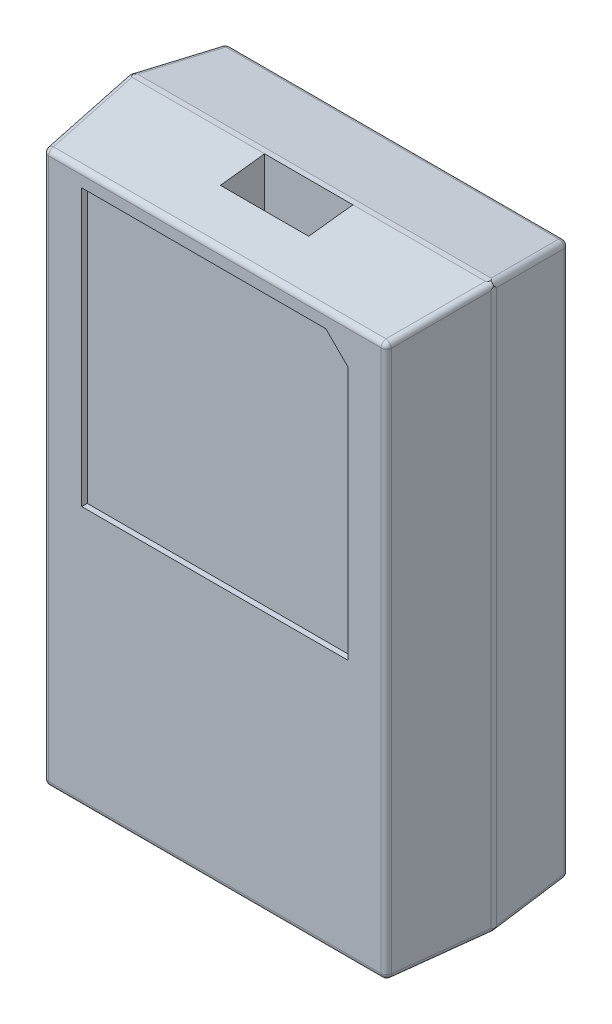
ISO-10303-21;
HEADER;
FILE_DESCRIPTION(('STEP AP214'),'2;1');
FILE_NAME('part.step','',(''),(''),'','','');
FILE_SCHEMA(('AUTOMOTIVE_DESIGN { 1 0 10303 214 1 1 1 1 }'));
ENDSEC;
DATA;
#1=APPLICATION_CONTEXT('core data for automotive mechanical design processes');
#2=APPLICATION_PROTOCOL_DEFINITION('international standard','automotive_design',2000,#1);
#3=PRODUCT_CONTEXT('',#1,'mechanical');
#4=PRODUCT('Part','Part','',(#3));
#5=PRODUCT_RELATED_PRODUCT_CATEGORY('part','',(#4));
#6=PRODUCT_DEFINITION_FORMATION('','',#4);
#7=PRODUCT_DEFINITION_CONTEXT('part definition',#1,'design');
#8=PRODUCT_DEFINITION('design','',#6,#7);
#9=PRODUCT_DEFINITION_SHAPE('','',#8);
#10=(LENGTH_UNIT() NAMED_UNIT(*) SI_UNIT(.MILLI.,.METRE.));
#11=(NAMED_UNIT(*) PLANE_ANGLE_UNIT() SI_UNIT($,.RADIAN.));
#12=(NAMED_UNIT(*) SI_UNIT($,.STERADIAN.) SOLID_ANGLE_UNIT());
#13=UNCERTAINTY_MEASURE_WITH_UNIT(LENGTH_MEASURE(1.E-05),#10,'distance_accuracy_value','');
#14=(GEOMETRIC_REPRESENTATION_CONTEXT(3) GLOBAL_UNCERTAINTY_ASSIGNED_CONTEXT((#13)) GLOBAL_UNIT_ASSIGNED_CONTEXT((#10,
#11,#12)) REPRESENTATION_CONTEXT('',''));
#15=CARTESIAN_POINT('',(0.,0.,0.));
#16=DIRECTION('',(0.,0.,1.));
#17=DIRECTION('',(1.,0.,0.));
#18=AXIS2_PLACEMENT_3D('',#15,#16,#17);
#19=CARTESIAN_POINT('',(22.75,0.,13.2));
#20=DIRECTION('',(0.,-1.,0.));
#21=DIRECTION('',(0.,0.,-1.));
#22=AXIS2_PLACEMENT_3D('',#19,#20,#21);
#23=PLANE('',#22);
#24=CARTESIAN_POINT('',(20.25,0.,11.1));
#25=DIRECTION('',(0.,-1.,0.));
#26=DIRECTION('',(0.,0.,-1.));
#27=AXIS2_PLACEMENT_3D('',#24,#25,#26);
#28=CIRCLE('',#27,0.75);
#29=CARTESIAN_POINT('',(20.25,0.,10.35));
#30=VERTEX_POINT('',#29);
#31=EDGE_CURVE('E18',#30,#30,#28,.F.);
#32=ORIENTED_EDGE('',*,*,#31,.F.);
#33=EDGE_LOOP('',(#32));
#34=FACE_BOUND('',#33,.T.);
#35=ADVANCED_FACE('F15',(#34),#23,.T.);
#36=CARTESIAN_POINT('',(22.75,0.,13.2));
#37=DIRECTION('',(0.,-1.,0.));
#38=DIRECTION('',(0.,0.,-1.));
#39=AXIS2_PLACEMENT_3D('',#36,#37,#38);
#40=PLANE('',#39);
#41=CARTESIAN_POINT('',(17.75,0.,11.1));
#42=DIRECTION('',(0.,-1.,0.));
#43=DIRECTION('',(0.,0.,-1.));
#44=AXIS2_PLACEMENT_3D('',#41,#42,#43);
#45=CIRCLE('',#44,0.75);
#46=CARTESIAN_POINT('',(17.75,0.,10.35));
#47=VERTEX_POINT('',#46);
#48=EDGE_CURVE('E667',#47,#47,#45,.F.);
#49=ORIENTED_EDGE('',*,*,#48,.F.);
#50=EDGE_LOOP('',(#49));
#51=FACE_BOUND('',#50,.T.);
#52=ADVANCED_FACE('F294',(#51),#40,.T.);
#53=CARTESIAN_POINT('',(22.75,0.,13.2));
#54=DIRECTION('',(0.,-1.,0.));
#55=DIRECTION('',(0.,0.,-1.));
#56=AXIS2_PLACEMENT_3D('',#53,#54,#55);
#57=PLANE('',#56);
#58=CARTESIAN_POINT('',(12.75,0.,11.1));
#59=DIRECTION('',(0.,-1.,0.));
#60=DIRECTION('',(0.,0.,-1.));
#61=AXIS2_PLACEMENT_3D('',#58,#59,#60);
#62=CIRCLE('',#61,0.75);
#63=CARTESIAN_POINT('',(12.75,0.,10.35));
#64=VERTEX_POINT('',#63);
#65=EDGE_CURVE('E665',#64,#64,#62,.F.);
#66=ORIENTED_EDGE('',*,*,#65,.F.);
#67=EDGE_LOOP('',(#66));
#68=FACE_BOUND('',#67,.T.);
#69=ADVANCED_FACE('F291',(#68),#57,.T.);
#70=CARTESIAN_POINT('',(22.75,0.,13.2));
#71=DIRECTION('',(0.,-1.,0.));
#72=DIRECTION('',(0.,0.,-1.));
#73=AXIS2_PLACEMENT_3D('',#70,#71,#72);
#74=PLANE('',#73);
#75=CARTESIAN_POINT('',(15.25,0.,11.1));
#76=DIRECTION('',(0.,-1.,0.));
#77=DIRECTION('',(0.,0.,-1.));
#78=AXIS2_PLACEMENT_3D('',#75,#76,#77);
#79=CIRCLE('',#78,0.75);
#80=CARTESIAN_POINT('',(15.25,0.,10.35));
#81=VERTEX_POINT('',#80);
#82=EDGE_CURVE('E262',#81,#81,#79,.F.);
#83=ORIENTED_EDGE('',*,*,#82,.F.);
#84=EDGE_LOOP('',(#83));
#85=FACE_BOUND('',#84,.T.);
#86=ADVANCED_FACE('F287',(#85),#74,.T.);
#87=CARTESIAN_POINT('',(18.328465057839,16.0855340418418,16.));
#88=DIRECTION('',(0.,0.,1.));
#89=DIRECTION('',(1.,0.,0.));
#90=AXIS2_PLACEMENT_3D('',#87,#88,#89);
#91=PLANE('',#90);
#92=DIRECTION('',(-0.707106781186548,0.707106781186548,0.));
#93=VECTOR('',#92,1.);
#94=CARTESIAN_POINT('',(27.5553752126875,47.5553752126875,16.));
#95=LINE('',#94,#93);
#96=CARTESIAN_POINT('',(28.5553752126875,46.5553752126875,16.));
#97=VERTEX_POINT('',#96);
#98=CARTESIAN_POINT('',(26.5553752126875,48.5553752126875,16.));
#99=VERTEX_POINT('',#98);
#100=EDGE_CURVE('E235',#97,#99,#95,.T.);
#101=ORIENTED_EDGE('',*,*,#100,.T.);
#102=DIRECTION('',(1.,0.,0.));
#103=VECTOR('',#102,1.);
#104=CARTESIAN_POINT('',(28.5553752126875,48.5553752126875,16.));
#105=LINE('',#104,#103);
#106=CARTESIAN_POINT('',(4.44462478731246,48.5553752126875,16.));
#107=VERTEX_POINT('',#106);
#108=EDGE_CURVE('E244',#99,#107,#105,.F.);
#109=ORIENTED_EDGE('',*,*,#108,.T.);
#110=DIRECTION('',(0.,1.,0.));
#111=VECTOR('',#110,1.);
#112=CARTESIAN_POINT('',(4.44462478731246,48.5553752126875,16.));
#113=LINE('',#112,#111);
#114=CARTESIAN_POINT('',(4.44462478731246,23.5553752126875,16.));
#115=VERTEX_POINT('',#114);
#116=EDGE_CURVE('E250',#107,#115,#113,.F.);
#117=ORIENTED_EDGE('',*,*,#116,.T.);
#118=DIRECTION('',(1.,0.,0.));
#119=VECTOR('',#118,1.);
#120=CARTESIAN_POINT('',(4.44462478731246,23.5553752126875,16.));
#121=LINE('',#120,#119);
#122=CARTESIAN_POINT('',(28.5553752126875,23.5553752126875,16.));
#123=VERTEX_POINT('',#122);
#124=EDGE_CURVE('E256',#115,#123,#121,.T.);
#125=ORIENTED_EDGE('',*,*,#124,.T.);
#126=DIRECTION('',(0.,1.,0.));
#127=VECTOR('',#126,1.);
#128=CARTESIAN_POINT('',(28.5553752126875,23.5553752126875,16.));
#129=LINE('',#128,#127);
#130=EDGE_CURVE('E259',#123,#97,#129,.T.);
#131=ORIENTED_EDGE('',*,*,#130,.T.);
#132=EDGE_LOOP('',(#101,#109,#117,#125,#131));
#133=FACE_BOUND('',#132,.T.);
#134=ADVANCED_FACE('F283',(#133),#91,.T.);
#135=CARTESIAN_POINT('',(31.5553752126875,49.5553752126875,16.));
#136=DIRECTION('',(0.,0.1168412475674,-0.993150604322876));
#137=DIRECTION('',(-1.,0.,0.));
#138=AXIS2_PLACEMENT_3D('',#135,#136,#137);
#139=SPHERICAL_SURFACE('',#138,0.5);
#140=CARTESIAN_POINT('',(31.5553752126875,49.5553752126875,16.));
#141=DIRECTION('',(0.,1.,0.));
#142=DIRECTION('',(0.,0.,1.));
#143=AXIS2_PLACEMENT_3D('',#140,#141,#142);
#144=CIRCLE('',#143,0.5);
#145=CARTESIAN_POINT('',(32.051950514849,49.5553752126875,16.0584206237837));
#146=VERTEX_POINT('',#145);
#147=CARTESIAN_POINT('',(31.5553752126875,49.5553752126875,16.5));
#148=VERTEX_POINT('',#147);
#149=EDGE_CURVE('E224',#146,#148,#144,.F.);
#150=ORIENTED_EDGE('',*,*,#149,.F.);
#151=CARTESIAN_POINT('',(31.5553752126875,49.5553752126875,16.));
#152=DIRECTION('',(-0.116051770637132,-0.116051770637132,0.986440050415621));
#153=DIRECTION('',(0.993150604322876,0.,0.116841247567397));
#154=AXIS2_PLACEMENT_3D('',#151,#152,#153);
#155=CIRCLE('',#154,0.5);
#156=CARTESIAN_POINT('',(31.5553752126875,50.051950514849,16.0584206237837));
#157=VERTEX_POINT('',#156);
#158=EDGE_CURVE('E170',#157,#146,#155,.F.);
#159=ORIENTED_EDGE('',*,*,#158,.F.);
#160=CARTESIAN_POINT('',(31.5553752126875,49.5553752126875,16.));
#161=DIRECTION('',(-1.,0.,0.));
#162=DIRECTION('',(0.,0.,1.));
#163=AXIS2_PLACEMENT_3D('',#160,#161,#162);
#164=CIRCLE('',#163,0.5);
#165=EDGE_CURVE('E215',#148,#157,#164,.T.);
#166=ORIENTED_EDGE('',*,*,#165,.F.);
#167=EDGE_LOOP('',(#150,#159,#166));
#168=FACE_BOUND('',#167,.T.);
#169=ADVANCED_FACE('F278',(#168),#139,.T.);
#170=CARTESIAN_POINT('',(1.44462478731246,49.5553752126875,16.));
#171=DIRECTION('',(0.1168412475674,0.,0.993150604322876));
#172=DIRECTION('',(0.,1.,0.));
#173=AXIS2_PLACEMENT_3D('',#170,#171,#172);
#174=SPHERICAL_SURFACE('',#173,0.5);
#175=CARTESIAN_POINT('',(1.44462478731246,49.5553752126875,16.));
#176=DIRECTION('',(-1.,0.,0.));
#177=DIRECTION('',(0.,0.,1.));
#178=AXIS2_PLACEMENT_3D('',#175,#176,#177);
#179=CIRCLE('',#178,0.5);
#180=CARTESIAN_POINT('',(1.44462478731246,50.051950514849,16.0584206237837));
#181=VERTEX_POINT('',#180);
#182=CARTESIAN_POINT('',(1.44462478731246,49.5553752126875,16.5));
#183=VERTEX_POINT('',#182);
#184=EDGE_CURVE('E645',#181,#183,#179,.F.);
#185=ORIENTED_EDGE('',*,*,#184,.F.);
#186=CARTESIAN_POINT('',(1.44462478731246,49.5553752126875,16.));
#187=DIRECTION('',(0.116051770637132,-0.116051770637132,0.986440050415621));
#188=DIRECTION('',(0.993150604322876,0.,-0.116841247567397));
#189=AXIS2_PLACEMENT_3D('',#186,#187,#188);
#190=CIRCLE('',#189,0.5);
#191=CARTESIAN_POINT('',(0.948049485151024,49.5553752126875,16.0584206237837));
#192=VERTEX_POINT('',#191);
#193=EDGE_CURVE('E207',#192,#181,#190,.F.);
#194=ORIENTED_EDGE('',*,*,#193,.F.);
#195=CARTESIAN_POINT('',(1.44462478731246,49.5553752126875,16.));
#196=DIRECTION('',(0.,-1.,0.));
#197=DIRECTION('',(0.,0.,-1.));
#198=AXIS2_PLACEMENT_3D('',#195,#196,#197);
#199=CIRCLE('',#198,0.5);
#200=EDGE_CURVE('E225',#183,#192,#199,.T.);
#201=ORIENTED_EDGE('',*,*,#200,.F.);
#202=EDGE_LOOP('',(#185,#194,#201));
#203=FACE_BOUND('',#202,.T.);
#204=ADVANCED_FACE('F273',(#203),#174,.T.);
#205=CARTESIAN_POINT('',(22.75,8.2,9.00000000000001));
#206=DIRECTION('',(0.,1.,0.));
#207=DIRECTION('',(0.,0.,1.));
#208=AXIS2_PLACEMENT_3D('',#205,#206,#207);
#209=PLANE('',#208);
#210=DIRECTION('',(0.,0.,1.));
#211=VECTOR('',#210,1.);
#212=CARTESIAN_POINT('',(10.25,8.2,9.00000000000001));
#213=LINE('',#212,#211);
#214=CARTESIAN_POINT('',(10.25,8.2,9.00000000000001));
#215=VERTEX_POINT('',#214);
#216=CARTESIAN_POINT('',(10.25,8.2,10.5));
#217=VERTEX_POINT('',#216);
#218=EDGE_CURVE('E263',#215,#217,#213,.T.);
#219=ORIENTED_EDGE('',*,*,#218,.T.);
#220=DIRECTION('',(1.,0.,0.));
#221=VECTOR('',#220,1.);
#222=CARTESIAN_POINT('',(22.75,8.2,10.5));
#223=LINE('',#222,#221);
#224=CARTESIAN_POINT('',(22.75,8.2,10.5));
#225=VERTEX_POINT('',#224);
#226=EDGE_CURVE('E647',#225,#217,#223,.F.);
#227=ORIENTED_EDGE('',*,*,#226,.F.);
#228=DIRECTION('',(0.,0.,1.));
#229=VECTOR('',#228,1.);
#230=CARTESIAN_POINT('',(22.75,8.2,9.00000000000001));
#231=LINE('',#230,#229);
#232=CARTESIAN_POINT('',(22.75,8.2,9.00000000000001));
#233=VERTEX_POINT('',#232);
#234=EDGE_CURVE('E266',#225,#233,#231,.F.);
#235=ORIENTED_EDGE('',*,*,#234,.T.);
#236=DIRECTION('',(-1.,0.,0.));
#237=VECTOR('',#236,1.);
#238=CARTESIAN_POINT('',(9.8,8.2,9.00000000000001));
#239=LINE('',#238,#237);
#240=EDGE_CURVE('E801',#233,#215,#239,.T.);
#241=ORIENTED_EDGE('',*,*,#240,.T.);
#242=EDGE_LOOP('',(#219,#227,#235,#241));
#243=FACE_BOUND('',#242,.T.);
#244=ADVANCED_FACE('F277',(#243),#209,.T.);
#245=CARTESIAN_POINT('',(20.25,0.,11.1));
#246=DIRECTION('',(0.,-1.,0.));
#247=DIRECTION('',(0.,0.,-1.));
#248=AXIS2_PLACEMENT_3D('',#245,#246,#247);
#249=CYLINDRICAL_SURFACE('',#248,0.75);
#250=ORIENTED_EDGE('',*,*,#31,.T.);
#251=EDGE_LOOP('',(#250));
#252=FACE_BOUND('',#251,.T.);
#253=CARTESIAN_POINT('',(20.25,4.,11.1));
#254=DIRECTION('',(0.,-1.,0.));
#255=DIRECTION('',(0.,0.,-1.));
#256=AXIS2_PLACEMENT_3D('',#253,#254,#255);
#257=CIRCLE('',#256,0.75);
#258=CARTESIAN_POINT('',(20.25,4.,10.35));
#259=VERTEX_POINT('',#258);
#260=EDGE_CURVE('E632',#259,#259,#257,.F.);
#261=ORIENTED_EDGE('',*,*,#260,.F.);
#262=EDGE_LOOP('',(#261));
#263=FACE_BOUND('',#262,.T.);
#264=ADVANCED_FACE('F619',(#252,#263),#249,.T.);
#265=CARTESIAN_POINT('',(17.75,0.,11.1));
#266=DIRECTION('',(0.,-1.,0.));
#267=DIRECTION('',(0.,0.,-1.));
#268=AXIS2_PLACEMENT_3D('',#265,#266,#267);
#269=CYLINDRICAL_SURFACE('',#268,0.75);
#270=ORIENTED_EDGE('',*,*,#48,.T.);
#271=EDGE_LOOP('',(#270));
#272=FACE_BOUND('',#271,.T.);
#273=CARTESIAN_POINT('',(17.75,4.,11.1));
#274=DIRECTION('',(0.,-1.,0.));
#275=DIRECTION('',(0.,0.,-1.));
#276=AXIS2_PLACEMENT_3D('',#273,#274,#275);
#277=CIRCLE('',#276,0.75);
#278=CARTESIAN_POINT('',(17.75,4.,10.35));
#279=VERTEX_POINT('',#278);
#280=EDGE_CURVE('E634',#279,#279,#277,.F.);
#281=ORIENTED_EDGE('',*,*,#280,.F.);
#282=EDGE_LOOP('',(#281));
#283=FACE_BOUND('',#282,.T.);
#284=ADVANCED_FACE('F616',(#272,#283),#269,.T.);
#285=CARTESIAN_POINT('',(12.75,0.,11.1));
#286=DIRECTION('',(0.,-1.,0.));
#287=DIRECTION('',(0.,0.,-1.));
#288=AXIS2_PLACEMENT_3D('',#285,#286,#287);
#289=CYLINDRICAL_SURFACE('',#288,0.75);
#290=CARTESIAN_POINT('',(12.75,4.,11.1));
#291=DIRECTION('',(0.,-1.,0.));
#292=DIRECTION('',(0.,0.,-1.));
#293=AXIS2_PLACEMENT_3D('',#290,#291,#292);
#294=CIRCLE('',#293,0.75);
#295=CARTESIAN_POINT('',(12.75,4.,10.35));
#296=VERTEX_POINT('',#295);
#297=EDGE_CURVE('E638',#296,#296,#294,.F.);
#298=ORIENTED_EDGE('',*,*,#297,.F.);
#299=EDGE_LOOP('',(#298));
#300=FACE_BOUND('',#299,.T.);
#301=ORIENTED_EDGE('',*,*,#65,.T.);
#302=EDGE_LOOP('',(#301));
#303=FACE_BOUND('',#302,.T.);
#304=ADVANCED_FACE('F612',(#300,#303),#289,.T.);
#305=CARTESIAN_POINT('',(15.25,0.,11.1));
#306=DIRECTION('',(0.,-1.,0.));
#307=DIRECTION('',(0.,0.,-1.));
#308=AXIS2_PLACEMENT_3D('',#305,#306,#307);
#309=CYLINDRICAL_SURFACE('',#308,0.75);
#310=CARTESIAN_POINT('',(15.25,4.,11.1));
#311=DIRECTION('',(0.,-1.,0.));
#312=DIRECTION('',(0.,0.,-1.));
#313=AXIS2_PLACEMENT_3D('',#310,#311,#312);
#314=CIRCLE('',#313,0.75);
#315=CARTESIAN_POINT('',(15.25,4.,10.35));
#316=VERTEX_POINT('',#315);
#317=EDGE_CURVE('E862',#316,#316,#314,.F.);
#318=ORIENTED_EDGE('',*,*,#317,.F.);
#319=EDGE_LOOP('',(#318));
#320=FACE_BOUND('',#319,.T.);
#321=ORIENTED_EDGE('',*,*,#82,.T.);
#322=EDGE_LOOP('',(#321));
#323=FACE_BOUND('',#322,.T.);
#324=ADVANCED_FACE('F608',(#320,#323),#309,.T.);
#325=CARTESIAN_POINT('',(28.5553752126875,23.5553752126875,16.5));
#326=DIRECTION('',(1.,0.,0.));
#327=DIRECTION('',(0.,0.,-1.));
#328=AXIS2_PLACEMENT_3D('',#325,#326,#327);
#329=PLANE('',#328);
#330=ORIENTED_EDGE('',*,*,#130,.F.);
#331=DIRECTION('',(0.,0.,-1.));
#332=VECTOR('',#331,1.);
#333=CARTESIAN_POINT('',(28.5553752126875,23.5553752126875,16.5));
#334=LINE('',#333,#332);
#335=CARTESIAN_POINT('',(28.5553752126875,23.5553752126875,16.5));
#336=VERTEX_POINT('',#335);
#337=EDGE_CURVE('E253',#123,#336,#334,.F.);
#338=ORIENTED_EDGE('',*,*,#337,.T.);
#339=DIRECTION('',(0.,1.,0.));
#340=VECTOR('',#339,1.);
#341=CARTESIAN_POINT('',(28.5553752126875,0.,16.5));
#342=LINE('',#341,#340);
#343=CARTESIAN_POINT('',(28.5553752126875,46.5553752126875,16.5));
#344=VERTEX_POINT('',#343);
#345=EDGE_CURVE('E528',#344,#336,#342,.F.);
#346=ORIENTED_EDGE('',*,*,#345,.F.);
#347=DIRECTION('',(0.,0.,1.));
#348=VECTOR('',#347,1.);
#349=CARTESIAN_POINT('',(28.5553752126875,46.5553752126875,16.25));
#350=LINE('',#349,#348);
#351=EDGE_CURVE('E238',#344,#97,#350,.F.);
#352=ORIENTED_EDGE('',*,*,#351,.T.);
#353=EDGE_LOOP('',(#330,#338,#346,#352));
#354=FACE_BOUND('',#353,.T.);
#355=ADVANCED_FACE('F604',(#354),#329,.F.);
#356=CARTESIAN_POINT('',(4.44462478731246,23.5553752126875,16.5));
#357=DIRECTION('',(0.,-1.,0.));
#358=DIRECTION('',(0.,0.,-1.));
#359=AXIS2_PLACEMENT_3D('',#356,#357,#358);
#360=PLANE('',#359);
#361=ORIENTED_EDGE('',*,*,#124,.F.);
#362=DIRECTION('',(0.,0.,1.));
#363=VECTOR('',#362,1.);
#364=CARTESIAN_POINT('',(4.44462478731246,23.5553752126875,16.5));
#365=LINE('',#364,#363);
#366=CARTESIAN_POINT('',(4.44462478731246,23.5553752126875,16.5));
#367=VERTEX_POINT('',#366);
#368=EDGE_CURVE('E247',#115,#367,#365,.T.);
#369=ORIENTED_EDGE('',*,*,#368,.T.);
#370=DIRECTION('',(1.,0.,0.));
#371=VECTOR('',#370,1.);
#372=CARTESIAN_POINT('',(0.,23.5553752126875,16.5));
#373=LINE('',#372,#371);
#374=EDGE_CURVE('E525',#336,#367,#373,.F.);
#375=ORIENTED_EDGE('',*,*,#374,.F.);
#376=ORIENTED_EDGE('',*,*,#337,.F.);
#377=EDGE_LOOP('',(#361,#369,#375,#376));
#378=FACE_BOUND('',#377,.T.);
#379=ADVANCED_FACE('F600',(#378),#360,.F.);
#380=CARTESIAN_POINT('',(4.44462478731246,48.5553752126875,16.5));
#381=DIRECTION('',(-1.,0.,0.));
#382=DIRECTION('',(0.,0.,1.));
#383=AXIS2_PLACEMENT_3D('',#380,#381,#382);
#384=PLANE('',#383);
#385=ORIENTED_EDGE('',*,*,#116,.F.);
#386=DIRECTION('',(0.,0.,1.));
#387=VECTOR('',#386,1.);
#388=CARTESIAN_POINT('',(4.44462478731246,48.5553752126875,16.5));
#389=LINE('',#388,#387);
#390=CARTESIAN_POINT('',(4.44462478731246,48.5553752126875,16.5));
#391=VERTEX_POINT('',#390);
#392=EDGE_CURVE('E241',#107,#391,#389,.T.);
#393=ORIENTED_EDGE('',*,*,#392,.T.);
#394=DIRECTION('',(0.,1.,0.));
#395=VECTOR('',#394,1.);
#396=CARTESIAN_POINT('',(4.44462478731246,0.,16.5));
#397=LINE('',#396,#395);
#398=EDGE_CURVE('E522',#367,#391,#397,.T.);
#399=ORIENTED_EDGE('',*,*,#398,.F.);
#400=ORIENTED_EDGE('',*,*,#368,.F.);
#401=EDGE_LOOP('',(#385,#393,#399,#400));
#402=FACE_BOUND('',#401,.T.);
#403=ADVANCED_FACE('F596',(#402),#384,.F.);
#404=CARTESIAN_POINT('',(28.5553752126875,48.5553752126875,16.5));
#405=DIRECTION('',(0.,1.,0.));
#406=DIRECTION('',(0.,0.,1.));
#407=AXIS2_PLACEMENT_3D('',#404,#405,#406);
#408=PLANE('',#407);
#409=DIRECTION('',(1.,0.,0.));
#410=VECTOR('',#409,1.);
#411=CARTESIAN_POINT('',(0.,48.5553752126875,16.5));
#412=LINE('',#411,#410);
#413=CARTESIAN_POINT('',(26.5553752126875,48.5553752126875,16.5));
#414=VERTEX_POINT('',#413);
#415=EDGE_CURVE('E519',#391,#414,#412,.T.);
#416=ORIENTED_EDGE('',*,*,#415,.F.);
#417=ORIENTED_EDGE('',*,*,#392,.F.);
#418=ORIENTED_EDGE('',*,*,#108,.F.);
#419=DIRECTION('',(0.,0.,1.));
#420=VECTOR('',#419,1.);
#421=CARTESIAN_POINT('',(26.5553752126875,48.5553752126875,16.25));
#422=LINE('',#421,#420);
#423=EDGE_CURVE('E227',#99,#414,#422,.T.);
#424=ORIENTED_EDGE('',*,*,#423,.T.);
#425=EDGE_LOOP('',(#416,#417,#418,#424));
#426=FACE_BOUND('',#425,.T.);
#427=ADVANCED_FACE('F592',(#426),#408,.F.);
#428=CARTESIAN_POINT('',(27.5553752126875,47.5553752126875,16.25));
#429=DIRECTION('',(0.707106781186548,0.707106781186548,0.));
#430=DIRECTION('',(-0.707106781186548,0.707106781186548,0.));
#431=AXIS2_PLACEMENT_3D('',#428,#429,#430);
#432=PLANE('',#431);
#433=ORIENTED_EDGE('',*,*,#100,.F.);
#434=ORIENTED_EDGE('',*,*,#351,.F.);
#435=DIRECTION('',(0.707106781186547,-0.707106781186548,0.));
#436=VECTOR('',#435,1.);
#437=CARTESIAN_POINT('',(26.5553752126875,48.5553752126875,16.5));
#438=LINE('',#437,#436);
#439=EDGE_CURVE('E516',#414,#344,#438,.T.);
#440=ORIENTED_EDGE('',*,*,#439,.F.);
#441=ORIENTED_EDGE('',*,*,#423,.F.);
#442=EDGE_LOOP('',(#433,#434,#440,#441));
#443=FACE_BOUND('',#442,.T.);
#444=ADVANCED_FACE('F588',(#443),#432,.F.);
#445=CARTESIAN_POINT('',(1.44462478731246,0.,16.));
#446=DIRECTION('',(0.,-1.,0.));
#447=DIRECTION('',(0.,0.,-1.));
#448=AXIS2_PLACEMENT_3D('',#445,#446,#447);
#449=CYLINDRICAL_SURFACE('',#448,0.5);
#450=CARTESIAN_POINT('',(1.44462478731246,0.500000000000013,16.));
#451=DIRECTION('',(0.,-1.,0.));
#452=DIRECTION('',(0.,0.,-1.));
#453=AXIS2_PLACEMENT_3D('',#450,#451,#452);
#454=CIRCLE('',#453,0.5);
#455=CARTESIAN_POINT('',(0.948049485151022,0.500000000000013,16.0584206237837));
#456=VERTEX_POINT('',#455);
#457=CARTESIAN_POINT('',(1.44462478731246,0.500000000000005,16.5));
#458=VERTEX_POINT('',#457);
#459=EDGE_CURVE('E221',#456,#458,#454,.F.);
#460=ORIENTED_EDGE('',*,*,#459,.T.);
#461=DIRECTION('',(0.,1.,0.));
#462=VECTOR('',#461,1.);
#463=CARTESIAN_POINT('',(1.44462478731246,0.,16.5));
#464=LINE('',#463,#462);
#465=EDGE_CURVE('E231',#183,#458,#464,.F.);
#466=ORIENTED_EDGE('',*,*,#465,.F.);
#467=ORIENTED_EDGE('',*,*,#200,.T.);
#468=DIRECTION('',(0.,1.,0.));
#469=VECTOR('',#468,1.);
#470=CARTESIAN_POINT('',(0.948049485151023,25.5,16.0584206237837));
#471=LINE('',#470,#469);
#472=EDGE_CURVE('E512',#456,#192,#471,.T.);
#473=ORIENTED_EDGE('',*,*,#472,.F.);
#474=EDGE_LOOP('',(#460,#466,#467,#473));
#475=FACE_BOUND('',#474,.T.);
#476=ADVANCED_FACE('F584',(#475),#449,.T.);
#477=CARTESIAN_POINT('',(31.5553752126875,0.,16.));
#478=DIRECTION('',(0.,1.,0.));
#479=DIRECTION('',(0.,0.,1.));
#480=AXIS2_PLACEMENT_3D('',#477,#478,#479);
#481=CYLINDRICAL_SURFACE('',#480,0.5);
#482=ORIENTED_EDGE('',*,*,#149,.T.);
#483=DIRECTION('',(0.,1.,0.));
#484=VECTOR('',#483,1.);
#485=CARTESIAN_POINT('',(31.5553752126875,0.,16.5));
#486=LINE('',#485,#484);
#487=CARTESIAN_POINT('',(31.5553752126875,0.500000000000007,16.5));
#488=VERTEX_POINT('',#487);
#489=EDGE_CURVE('E232',#488,#148,#486,.T.);
#490=ORIENTED_EDGE('',*,*,#489,.F.);
#491=CARTESIAN_POINT('',(31.5553752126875,0.5,16.));
#492=DIRECTION('',(0.,-1.,0.));
#493=DIRECTION('',(0.116841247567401,0.,-0.993150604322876));
#494=AXIS2_PLACEMENT_3D('',#491,#492,#493);
#495=CIRCLE('',#494,0.5);
#496=CARTESIAN_POINT('',(32.051950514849,0.499999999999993,16.0584206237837));
#497=VERTEX_POINT('',#496);
#498=EDGE_CURVE('E531',#497,#488,#495,.T.);
#499=ORIENTED_EDGE('',*,*,#498,.F.);
#500=DIRECTION('',(0.,1.,0.));
#501=VECTOR('',#500,1.);
#502=CARTESIAN_POINT('',(32.051950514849,25.5,16.0584206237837));
#503=LINE('',#502,#501);
#504=EDGE_CURVE('E780',#146,#497,#503,.F.);
#505=ORIENTED_EDGE('',*,*,#504,.F.);
#506=EDGE_LOOP('',(#482,#490,#499,#505));
#507=FACE_BOUND('',#506,.T.);
#508=ADVANCED_FACE('F581',(#507),#481,.T.);
#509=CARTESIAN_POINT('',(7.95556383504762,41.,7.76807606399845));
#510=DIRECTION('',(0.,1.,0.));
#511=DIRECTION('',(0.,0.,1.));
#512=AXIS2_PLACEMENT_3D('',#509,#510,#511);
#513=PLANE('',#512);
#514=DIRECTION('',(0.,0.,1.));
#515=VECTOR('',#514,1.);
#516=CARTESIAN_POINT('',(12.5,41.,8.));
#517=LINE('',#516,#515);
#518=CARTESIAN_POINT('',(12.5,41.,8.));
#519=VERTEX_POINT('',#518);
#520=CARTESIAN_POINT('',(12.5,41.,12.));
#521=VERTEX_POINT('',#520);
#522=EDGE_CURVE('E203',#519,#521,#517,.T.);
#523=ORIENTED_EDGE('',*,*,#522,.T.);
#524=DIRECTION('',(1.,0.,0.));
#525=VECTOR('',#524,1.);
#526=CARTESIAN_POINT('',(12.5,41.,12.));
#527=LINE('',#526,#525);
#528=CARTESIAN_POINT('',(20.5,41.,12.));
#529=VERTEX_POINT('',#528);
#530=EDGE_CURVE('E191',#521,#529,#527,.T.);
#531=ORIENTED_EDGE('',*,*,#530,.T.);
#532=DIRECTION('',(0.,0.,-1.));
#533=VECTOR('',#532,1.);
#534=CARTESIAN_POINT('',(20.5,41.,12.));
#535=LINE('',#534,#533);
#536=CARTESIAN_POINT('',(20.5,41.,8.));
#537=VERTEX_POINT('',#536);
#538=EDGE_CURVE('E178',#529,#537,#535,.T.);
#539=ORIENTED_EDGE('',*,*,#538,.T.);
#540=DIRECTION('',(-1.,0.,0.));
#541=VECTOR('',#540,1.);
#542=CARTESIAN_POINT('',(20.5,41.,8.));
#543=LINE('',#542,#541);
#544=EDGE_CURVE('E210',#537,#519,#543,.T.);
#545=ORIENTED_EDGE('',*,*,#544,.T.);
#546=EDGE_LOOP('',(#523,#531,#539,#545));
#547=FACE_BOUND('',#546,.T.);
#548=ADVANCED_FACE('F209',(#547),#513,.T.);
#549=CARTESIAN_POINT('',(33.437728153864,51.437728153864,0.));
#550=DIRECTION('',(-0.116051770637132,-0.116051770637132,0.986440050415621));
#551=DIRECTION('',(0.993150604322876,0.,0.116841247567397));
#552=AXIS2_PLACEMENT_3D('',#549,#550,#551);
#553=CYLINDRICAL_SURFACE('',#552,0.5);
#554=CARTESIAN_POINT('',(32.5273439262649,50.5273439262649,7.73826593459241));
#555=DIRECTION('',(0.00760324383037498,0.00760324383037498,0.999942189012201));
#556=DIRECTION('',(-0.707065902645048,-0.707065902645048,0.0107526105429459));
#557=AXIS2_PLACEMENT_3D('',#554,#555,#556);
#558=ELLIPSE('',#557,0.507811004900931,0.5);
#559=CARTESIAN_POINT('',(33.,50.7093140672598,7.7332883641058));
#560=VERTEX_POINT('',#559);
#561=CARTESIAN_POINT('',(32.7093140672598,51.,7.7332883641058));
#562=VERTEX_POINT('',#561);
#563=EDGE_CURVE('E656',#560,#562,#558,.T.);
#564=ORIENTED_EDGE('',*,*,#563,.T.);
#565=CARTESIAN_POINT('',(33.,51.,3.72068930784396));
#566=DIRECTION('',(0.,1.,0.));
#567=DIRECTION('',(-0.116841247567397,0.,0.993150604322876));
#568=AXIS2_PLACEMENT_3D('',#565,#566,#567);
#569=ELLIPSE('',#568,4.30842198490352,0.5);
#570=CARTESIAN_POINT('',(32.5034246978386,51.,7.99999999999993));
#571=VERTEX_POINT('',#570);
#572=EDGE_CURVE('E220',#562,#571,#569,.F.);
#573=ORIENTED_EDGE('',*,*,#572,.T.);
#574=DIRECTION('',(0.11605177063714,0.116051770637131,-0.98644005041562));
#575=VECTOR('',#574,1.);
#576=CARTESIAN_POINT('',(31.5553752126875,50.051950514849,16.0584206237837));
#577=LINE('',#576,#575);
#578=EDGE_CURVE('E767',#157,#571,#577,.T.);
#579=ORIENTED_EDGE('',*,*,#578,.F.);
#580=ORIENTED_EDGE('',*,*,#158,.T.);
#581=DIRECTION('',(-0.116051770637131,-0.11605177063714,0.98644005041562));
#582=VECTOR('',#581,1.);
#583=CARTESIAN_POINT('',(33.,50.5034246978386,7.99999999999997));
#584=LINE('',#583,#582);
#585=CARTESIAN_POINT('',(33.,50.5034246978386,7.99999999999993));
#586=VERTEX_POINT('',#585);
#587=EDGE_CURVE('E510',#586,#146,#584,.T.);
#588=ORIENTED_EDGE('',*,*,#587,.F.);
#589=CARTESIAN_POINT('',(33.,51.,3.72068930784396));
#590=DIRECTION('',(1.,0.,0.));
#591=DIRECTION('',(0.,-0.116841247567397,0.993150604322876));
#592=AXIS2_PLACEMENT_3D('',#589,#590,#591);
#593=ELLIPSE('',#592,4.30842198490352,0.5);
#594=EDGE_CURVE('E658',#586,#560,#593,.F.);
#595=ORIENTED_EDGE('',*,*,#594,.T.);
#596=EDGE_LOOP('',(#564,#573,#579,#580,#588,#595));
#597=FACE_BOUND('',#596,.T.);
#598=ADVANCED_FACE('F576',(#597),#553,.T.);
#599=CARTESIAN_POINT('',(20.5,51.,12.));
#600=DIRECTION('',(1.,0.,0.));
#601=DIRECTION('',(0.,0.,-1.));
#602=AXIS2_PLACEMENT_3D('',#599,#600,#601);
#603=PLANE('',#602);
#604=ORIENTED_EDGE('',*,*,#538,.F.);
#605=DIRECTION('',(0.,1.,0.));
#606=VECTOR('',#605,1.);
#607=CARTESIAN_POINT('',(20.5,51.,12.));
#608=LINE('',#607,#606);
#609=CARTESIAN_POINT('',(20.5,50.5294117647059,12.));
#610=VERTEX_POINT('',#609);
#611=EDGE_CURVE('E197',#529,#610,#608,.T.);
#612=ORIENTED_EDGE('',*,*,#611,.T.);
#613=DIRECTION('',(0.,-0.116841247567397,0.993150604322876));
#614=VECTOR('',#613,1.);
#615=CARTESIAN_POINT('',(20.5,50.5,12.25));
#616=LINE('',#615,#614);
#617=CARTESIAN_POINT('',(20.5,51.,7.99999999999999));
#618=VERTEX_POINT('',#617);
#619=EDGE_CURVE('E770',#618,#610,#616,.T.);
#620=ORIENTED_EDGE('',*,*,#619,.F.);
#621=DIRECTION('',(0.,1.,0.));
#622=VECTOR('',#621,1.);
#623=CARTESIAN_POINT('',(20.5,51.,8.));
#624=LINE('',#623,#622);
#625=EDGE_CURVE('E218',#618,#537,#624,.F.);
#626=ORIENTED_EDGE('',*,*,#625,.T.);
#627=EDGE_LOOP('',(#604,#612,#620,#626));
#628=FACE_BOUND('',#627,.T.);
#629=ADVANCED_FACE('F573',(#628),#603,.F.);
#630=CARTESIAN_POINT('',(12.5,51.,12.));
#631=DIRECTION('',(0.,0.,1.));
#632=DIRECTION('',(1.,0.,0.));
#633=AXIS2_PLACEMENT_3D('',#630,#631,#632);
#634=PLANE('',#633);
#635=ORIENTED_EDGE('',*,*,#530,.F.);
#636=DIRECTION('',(0.,1.,0.));
#637=VECTOR('',#636,1.);
#638=CARTESIAN_POINT('',(12.5,51.,12.));
#639=LINE('',#638,#637);
#640=CARTESIAN_POINT('',(12.5,50.5294117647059,12.));
#641=VERTEX_POINT('',#640);
#642=EDGE_CURVE('E195',#521,#641,#639,.T.);
#643=ORIENTED_EDGE('',*,*,#642,.T.);
#644=DIRECTION('',(1.,0.,0.));
#645=VECTOR('',#644,1.);
#646=CARTESIAN_POINT('',(16.5,50.5294117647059,12.));
#647=LINE('',#646,#645);
#648=EDGE_CURVE('E773',#610,#641,#647,.F.);
#649=ORIENTED_EDGE('',*,*,#648,.F.);
#650=ORIENTED_EDGE('',*,*,#611,.F.);
#651=EDGE_LOOP('',(#635,#643,#649,#650));
#652=FACE_BOUND('',#651,.T.);
#653=ADVANCED_FACE('F193',(#652),#634,.F.);
#654=CARTESIAN_POINT('',(12.5,51.,8.));
#655=DIRECTION('',(-1.,0.,0.));
#656=DIRECTION('',(0.,0.,1.));
#657=AXIS2_PLACEMENT_3D('',#654,#655,#656);
#658=PLANE('',#657);
#659=ORIENTED_EDGE('',*,*,#522,.F.);
#660=DIRECTION('',(0.,1.,0.));
#661=VECTOR('',#660,1.);
#662=CARTESIAN_POINT('',(12.5,51.,8.));
#663=LINE('',#662,#661);
#664=CARTESIAN_POINT('',(12.5,51.,8.));
#665=VERTEX_POINT('',#664);
#666=EDGE_CURVE('E217',#519,#665,#663,.T.);
#667=ORIENTED_EDGE('',*,*,#666,.T.);
#668=DIRECTION('',(0.,-0.116841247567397,0.993150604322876));
#669=VECTOR('',#668,1.);
#670=CARTESIAN_POINT('',(12.5,50.5,12.25));
#671=LINE('',#670,#669);
#672=EDGE_CURVE('E206',#641,#665,#671,.F.);
#673=ORIENTED_EDGE('',*,*,#672,.F.);
#674=ORIENTED_EDGE('',*,*,#642,.F.);
#675=EDGE_LOOP('',(#659,#667,#673,#674));
#676=FACE_BOUND('',#675,.T.);
#677=ADVANCED_FACE('F201',(#676),#658,.F.);
#678=CARTESIAN_POINT('',(-0.437728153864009,51.437728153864,0.));
#679=DIRECTION('',(0.116051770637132,-0.116051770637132,0.986440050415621));
#680=DIRECTION('',(0.993150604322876,0.,-0.116841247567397));
#681=AXIS2_PLACEMENT_3D('',#678,#679,#680);
#682=CYLINDRICAL_SURFACE('',#681,0.5);
#683=CARTESIAN_POINT('',(0.47265607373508,50.5273439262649,7.73826593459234));
#684=DIRECTION('',(-0.00760324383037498,0.00760324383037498,0.999942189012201));
#685=DIRECTION('',(0.707065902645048,-0.707065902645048,0.0107526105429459));
#686=AXIS2_PLACEMENT_3D('',#683,#684,#685);
#687=ELLIPSE('',#686,0.507811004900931,0.5);
#688=CARTESIAN_POINT('',(0.290685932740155,51.,7.73328836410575));
#689=VERTEX_POINT('',#688);
#690=CARTESIAN_POINT('',(0.,50.7093140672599,7.7332883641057));
#691=VERTEX_POINT('',#690);
#692=EDGE_CURVE('E650',#689,#691,#687,.T.);
#693=ORIENTED_EDGE('',*,*,#692,.T.);
#694=CARTESIAN_POINT('',(0.,51.,3.72068930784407));
#695=DIRECTION('',(-1.,0.,0.));
#696=DIRECTION('',(0.,-0.116841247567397,0.993150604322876));
#697=AXIS2_PLACEMENT_3D('',#694,#695,#696);
#698=ELLIPSE('',#697,4.30842198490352,0.5);
#699=CARTESIAN_POINT('',(0.,50.5034246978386,8.));
#700=VERTEX_POINT('',#699);
#701=EDGE_CURVE('E648',#691,#700,#698,.F.);
#702=ORIENTED_EDGE('',*,*,#701,.T.);
#703=DIRECTION('',(-0.116051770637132,0.11605177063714,-0.98644005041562));
#704=VECTOR('',#703,1.);
#705=CARTESIAN_POINT('',(0.948049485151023,49.5553752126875,16.0584206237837));
#706=LINE('',#705,#704);
#707=EDGE_CURVE('E515',#192,#700,#706,.T.);
#708=ORIENTED_EDGE('',*,*,#707,.F.);
#709=ORIENTED_EDGE('',*,*,#193,.T.);
#710=DIRECTION('',(0.116051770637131,-0.116051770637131,0.986440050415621));
#711=VECTOR('',#710,1.);
#712=CARTESIAN_POINT('',(0.496575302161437,51.,7.99999999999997));
#713=LINE('',#712,#711);
#714=CARTESIAN_POINT('',(0.496575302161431,51.,7.99999999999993));
#715=VERTEX_POINT('',#714);
#716=EDGE_CURVE('E782',#715,#181,#713,.T.);
#717=ORIENTED_EDGE('',*,*,#716,.F.);
#718=CARTESIAN_POINT('',(0.,51.,3.72068930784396));
#719=DIRECTION('',(0.,1.,0.));
#720=DIRECTION('',(0.116841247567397,0.,0.993150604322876));
#721=AXIS2_PLACEMENT_3D('',#718,#719,#720);
#722=ELLIPSE('',#721,4.30842198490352,0.5);
#723=EDGE_CURVE('E652',#715,#689,#722,.F.);
#724=ORIENTED_EDGE('',*,*,#723,.T.);
#725=EDGE_LOOP('',(#693,#702,#708,#709,#717,#724));
#726=FACE_BOUND('',#725,.T.);
#727=ADVANCED_FACE('F564',(#726),#682,.T.);
#728=CARTESIAN_POINT('',(0.,49.5553752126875,16.));
#729=DIRECTION('',(-1.,0.,0.));
#730=DIRECTION('',(0.,0.,1.));
#731=AXIS2_PLACEMENT_3D('',#728,#729,#730);
#732=CYLINDRICAL_SURFACE('',#731,0.5);
#733=ORIENTED_EDGE('',*,*,#184,.T.);
#734=DIRECTION('',(1.,0.,0.));
#735=VECTOR('',#734,1.);
#736=CARTESIAN_POINT('',(0.,49.5553752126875,16.5));
#737=LINE('',#736,#735);
#738=EDGE_CURVE('E228',#148,#183,#737,.F.);
#739=ORIENTED_EDGE('',*,*,#738,.F.);
#740=ORIENTED_EDGE('',*,*,#165,.T.);
#741=DIRECTION('',(1.,0.,0.));
#742=VECTOR('',#741,1.);
#743=CARTESIAN_POINT('',(16.5,50.051950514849,16.0584206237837));
#744=LINE('',#743,#742);
#745=EDGE_CURVE('E766',#181,#157,#744,.T.);
#746=ORIENTED_EDGE('',*,*,#745,.F.);
#747=EDGE_LOOP('',(#733,#739,#740,#746));
#748=FACE_BOUND('',#747,.T.);
#749=ADVANCED_FACE('F560',(#748),#732,.T.);
#750=CARTESIAN_POINT('',(22.75,6.,11.1));
#751=DIRECTION('',(0.,1.,0.));
#752=DIRECTION('',(0.,0.,1.));
#753=AXIS2_PLACEMENT_3D('',#750,#751,#752);
#754=PLANE('',#753);
#755=DIRECTION('',(0.,0.,1.));
#756=VECTOR('',#755,1.);
#757=CARTESIAN_POINT('',(10.25,6.00000000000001,8.24196396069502));
#758=LINE('',#757,#756);
#759=CARTESIAN_POINT('',(10.25,6.,13.2));
#760=VERTEX_POINT('',#759);
#761=CARTESIAN_POINT('',(10.25,6.00000000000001,11.1));
#762=VERTEX_POINT('',#761);
#763=EDGE_CURVE('E734',#760,#762,#758,.F.);
#764=ORIENTED_EDGE('',*,*,#763,.F.);
#765=DIRECTION('',(1.,0.,0.));
#766=VECTOR('',#765,1.);
#767=CARTESIAN_POINT('',(22.75,6.,13.2));
#768=LINE('',#767,#766);
#769=CARTESIAN_POINT('',(22.75,6.,13.2));
#770=VERTEX_POINT('',#769);
#771=EDGE_CURVE('E743',#770,#760,#768,.F.);
#772=ORIENTED_EDGE('',*,*,#771,.F.);
#773=DIRECTION('',(0.,0.,1.));
#774=VECTOR('',#773,1.);
#775=CARTESIAN_POINT('',(22.75,6.,8.24196396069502));
#776=LINE('',#775,#774);
#777=CARTESIAN_POINT('',(22.75,6.,11.1));
#778=VERTEX_POINT('',#777);
#779=EDGE_CURVE('E752',#770,#778,#776,.F.);
#780=ORIENTED_EDGE('',*,*,#779,.T.);
#781=DIRECTION('',(1.,0.,0.));
#782=VECTOR('',#781,1.);
#783=CARTESIAN_POINT('',(22.75,6.00000000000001,11.1));
#784=LINE('',#783,#782);
#785=EDGE_CURVE('E795',#762,#778,#784,.T.);
#786=ORIENTED_EDGE('',*,*,#785,.F.);
#787=EDGE_LOOP('',(#764,#772,#780,#786));
#788=FACE_BOUND('',#787,.T.);
#789=ADVANCED_FACE('F556',(#788),#754,.T.);
#790=CARTESIAN_POINT('',(22.75,8.2,10.5));
#791=DIRECTION('',(0.,0.26311740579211,0.964763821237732));
#792=DIRECTION('',(0.,-0.964763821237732,0.26311740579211));
#793=AXIS2_PLACEMENT_3D('',#790,#791,#792);
#794=PLANE('',#793);
#795=DIRECTION('',(0.,0.964763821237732,-0.26311740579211));
#796=VECTOR('',#795,1.);
#797=CARTESIAN_POINT('',(10.25,6.00000000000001,11.1));
#798=LINE('',#797,#796);
#799=EDGE_CURVE('E731',#762,#217,#798,.T.);
#800=ORIENTED_EDGE('',*,*,#799,.F.);
#801=ORIENTED_EDGE('',*,*,#785,.T.);
#802=DIRECTION('',(0.,0.964763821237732,-0.263117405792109));
#803=VECTOR('',#802,1.);
#804=CARTESIAN_POINT('',(22.75,6.,11.1));
#805=LINE('',#804,#803);
#806=EDGE_CURVE('E749',#778,#225,#805,.T.);
#807=ORIENTED_EDGE('',*,*,#806,.T.);
#808=ORIENTED_EDGE('',*,*,#226,.T.);
#809=EDGE_LOOP('',(#800,#801,#807,#808));
#810=FACE_BOUND('',#809,.T.);
#811=ADVANCED_FACE('F552',(#810),#794,.T.);
#812=CARTESIAN_POINT('',(9.8,0.,9.00000000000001));
#813=DIRECTION('',(0.,0.,-1.));
#814=DIRECTION('',(-1.,0.,0.));
#815=AXIS2_PLACEMENT_3D('',#812,#813,#814);
#816=PLANE('',#815);
#817=DIRECTION('',(1.,0.,0.));
#818=VECTOR('',#817,1.);
#819=CARTESIAN_POINT('',(26.8695451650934,10.,9.00000000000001));
#820=LINE('',#819,#818);
#821=CARTESIAN_POINT('',(9.8,10.,9.00000000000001));
#822=VERTEX_POINT('',#821);
#823=CARTESIAN_POINT('',(23.2,10.,9.00000000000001));
#824=VERTEX_POINT('',#823);
#825=EDGE_CURVE('E635',#822,#824,#820,.T.);
#826=ORIENTED_EDGE('',*,*,#825,.F.);
#827=DIRECTION('',(0.,1.,0.));
#828=VECTOR('',#827,1.);
#829=CARTESIAN_POINT('',(9.8,0.,9.00000000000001));
#830=LINE('',#829,#828);
#831=CARTESIAN_POINT('',(9.8,0.,9.00000000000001));
#832=VERTEX_POINT('',#831);
#833=EDGE_CURVE('E725',#822,#832,#830,.F.);
#834=ORIENTED_EDGE('',*,*,#833,.T.);
#835=DIRECTION('',(-1.,0.,0.));
#836=VECTOR('',#835,1.);
#837=CARTESIAN_POINT('',(9.8,0.,9.00000000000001));
#838=LINE('',#837,#836);
#839=CARTESIAN_POINT('',(10.25,0.,9.00000000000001));
#840=VERTEX_POINT('',#839);
#841=EDGE_CURVE('E641',#840,#832,#838,.T.);
#842=ORIENTED_EDGE('',*,*,#841,.F.);
#843=DIRECTION('',(0.,-1.,0.));
#844=VECTOR('',#843,1.);
#845=CARTESIAN_POINT('',(10.25,8.33382955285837,9.00000000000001));
#846=LINE('',#845,#844);
#847=EDGE_CURVE('E740',#215,#840,#846,.T.);
#848=ORIENTED_EDGE('',*,*,#847,.F.);
#849=ORIENTED_EDGE('',*,*,#240,.F.);
#850=DIRECTION('',(0.,-1.,0.));
#851=VECTOR('',#850,1.);
#852=CARTESIAN_POINT('',(22.75,8.33382955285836,9.00000000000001));
#853=LINE('',#852,#851);
#854=CARTESIAN_POINT('',(22.75,0.,9.00000000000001));
#855=VERTEX_POINT('',#854);
#856=EDGE_CURVE('E755',#233,#855,#853,.T.);
#857=ORIENTED_EDGE('',*,*,#856,.T.);
#858=DIRECTION('',(-1.,0.,0.));
#859=VECTOR('',#858,1.);
#860=CARTESIAN_POINT('',(9.8,0.,9.00000000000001));
#861=LINE('',#860,#859);
#862=CARTESIAN_POINT('',(23.2,0.,9.00000000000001));
#863=VERTEX_POINT('',#862);
#864=EDGE_CURVE('E798',#863,#855,#861,.T.);
#865=ORIENTED_EDGE('',*,*,#864,.F.);
#866=DIRECTION('',(0.,1.,0.));
#867=VECTOR('',#866,1.);
#868=CARTESIAN_POINT('',(23.2,0.,9.00000000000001));
#869=LINE('',#868,#867);
#870=EDGE_CURVE('E716',#863,#824,#869,.T.);
#871=ORIENTED_EDGE('',*,*,#870,.T.);
#872=EDGE_LOOP('',(#826,#834,#842,#848,#849,#857,#865,#871));
#873=FACE_BOUND('',#872,.T.);
#874=ADVANCED_FACE('F548',(#873),#816,.F.);
#875=CARTESIAN_POINT('',(26.8695451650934,10.,11.6793056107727));
#876=DIRECTION('',(0.,-1.,0.));
#877=DIRECTION('',(0.,0.,-1.));
#878=AXIS2_PLACEMENT_3D('',#875,#876,#877);
#879=PLANE('',#878);
#880=DIRECTION('',(0.,0.,-1.));
#881=VECTOR('',#880,1.);
#882=CARTESIAN_POINT('',(23.2,10.,9.00000000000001));
#883=LINE('',#882,#881);
#884=CARTESIAN_POINT('',(23.2,10.,13.7));
#885=VERTEX_POINT('',#884);
#886=EDGE_CURVE('E713',#824,#885,#883,.F.);
#887=ORIENTED_EDGE('',*,*,#886,.T.);
#888=DIRECTION('',(1.,0.,0.));
#889=VECTOR('',#888,1.);
#890=CARTESIAN_POINT('',(23.2,10.,13.7));
#891=LINE('',#890,#889);
#892=CARTESIAN_POINT('',(9.8,10.,13.7));
#893=VERTEX_POINT('',#892);
#894=EDGE_CURVE('E722',#885,#893,#891,.F.);
#895=ORIENTED_EDGE('',*,*,#894,.T.);
#896=DIRECTION('',(0.,0.,1.));
#897=VECTOR('',#896,1.);
#898=CARTESIAN_POINT('',(9.8,10.,13.7));
#899=LINE('',#898,#897);
#900=EDGE_CURVE('E728',#893,#822,#899,.F.);
#901=ORIENTED_EDGE('',*,*,#900,.T.);
#902=ORIENTED_EDGE('',*,*,#825,.T.);
#903=EDGE_LOOP('',(#887,#895,#901,#902));
#904=FACE_BOUND('',#903,.T.);
#905=ADVANCED_FACE('F544',(#904),#879,.T.);
#906=CARTESIAN_POINT('',(17.736684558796,4.,11.276027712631));
#907=DIRECTION('',(0.,-1.,0.));
#908=DIRECTION('',(0.,0.,-1.));
#909=AXIS2_PLACEMENT_3D('',#906,#907,#908);
#910=PLANE('',#909);
#911=ORIENTED_EDGE('',*,*,#317,.T.);
#912=EDGE_LOOP('',(#911));
#913=FACE_BOUND('',#912,.T.);
#914=ORIENTED_EDGE('',*,*,#297,.T.);
#915=EDGE_LOOP('',(#914));
#916=FACE_BOUND('',#915,.T.);
#917=ORIENTED_EDGE('',*,*,#280,.T.);
#918=EDGE_LOOP('',(#917));
#919=FACE_BOUND('',#918,.T.);
#920=ORIENTED_EDGE('',*,*,#260,.T.);
#921=EDGE_LOOP('',(#920));
#922=FACE_BOUND('',#921,.T.);
#923=DIRECTION('',(1.,0.,0.));
#924=VECTOR('',#923,1.);
#925=CARTESIAN_POINT('',(10.75,4.,9.50000000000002));
#926=LINE('',#925,#924);
#927=CARTESIAN_POINT('',(10.75,4.,9.50000000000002));
#928=VERTEX_POINT('',#927);
#929=CARTESIAN_POINT('',(22.25,4.,9.50000000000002));
#930=VERTEX_POINT('',#929);
#931=EDGE_CURVE('E678',#928,#930,#926,.T.);
#932=ORIENTED_EDGE('',*,*,#931,.T.);
#933=DIRECTION('',(0.,0.,-1.));
#934=VECTOR('',#933,1.);
#935=CARTESIAN_POINT('',(22.25,3.99999999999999,9.50000000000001));
#936=LINE('',#935,#934);
#937=CARTESIAN_POINT('',(22.25,4.,12.7));
#938=VERTEX_POINT('',#937);
#939=EDGE_CURVE('E682',#930,#938,#936,.F.);
#940=ORIENTED_EDGE('',*,*,#939,.T.);
#941=DIRECTION('',(1.,0.,0.));
#942=VECTOR('',#941,1.);
#943=CARTESIAN_POINT('',(22.25,4.,12.7));
#944=LINE('',#943,#942);
#945=CARTESIAN_POINT('',(10.75,4.,12.7));
#946=VERTEX_POINT('',#945);
#947=EDGE_CURVE('E707',#938,#946,#944,.F.);
#948=ORIENTED_EDGE('',*,*,#947,.T.);
#949=DIRECTION('',(0.,0.,1.));
#950=VECTOR('',#949,1.);
#951=CARTESIAN_POINT('',(10.75,4.,12.7));
#952=LINE('',#951,#950);
#953=EDGE_CURVE('E685',#946,#928,#952,.F.);
#954=ORIENTED_EDGE('',*,*,#953,.T.);
#955=EDGE_LOOP('',(#932,#940,#948,#954));
#956=FACE_BOUND('',#955,.T.);
#957=ADVANCED_FACE('F540',(#913,#916,#919,#922,#956),#910,.T.);
#958=CARTESIAN_POINT('',(31.5553752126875,0.500000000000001,16.));
#959=DIRECTION('',(0.116841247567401,0.,-0.993150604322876));
#960=DIRECTION('',(0.,1.,0.));
#961=AXIS2_PLACEMENT_3D('',#958,#959,#960);
#962=SPHERICAL_SURFACE('',#961,0.5);
#963=CARTESIAN_POINT('',(31.5553752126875,0.500000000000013,16.));
#964=DIRECTION('',(1.,0.,0.));
#965=DIRECTION('',(0.,0.,-1.));
#966=AXIS2_PLACEMENT_3D('',#963,#964,#965);
#967=CIRCLE('',#966,0.5);
#968=CARTESIAN_POINT('',(31.5553752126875,0.,16.));
#969=VERTEX_POINT('',#968);
#970=EDGE_CURVE('E813',#969,#488,#967,.F.);
#971=ORIENTED_EDGE('',*,*,#970,.F.);
#972=CARTESIAN_POINT('',(31.5553752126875,0.499999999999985,16.));
#973=DIRECTION('',(0.116841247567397,0.,-0.993150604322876));
#974=DIRECTION('',(-0.993150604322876,0.,-0.116841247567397));
#975=AXIS2_PLACEMENT_3D('',#972,#973,#974);
#976=CIRCLE('',#975,0.5);
#977=EDGE_CURVE('E842',#497,#969,#976,.T.);
#978=ORIENTED_EDGE('',*,*,#977,.F.);
#979=ORIENTED_EDGE('',*,*,#498,.T.);
#980=EDGE_LOOP('',(#971,#978,#979));
#981=FACE_BOUND('',#980,.T.);
#982=ADVANCED_FACE('F536',(#981),#962,.T.);
#983=CARTESIAN_POINT('',(0.,0.,16.5));
#984=DIRECTION('',(0.,0.,1.));
#985=DIRECTION('',(1.,0.,0.));
#986=AXIS2_PLACEMENT_3D('',#983,#984,#985);
#987=PLANE('',#986);
#988=ORIENTED_EDGE('',*,*,#738,.T.);
#989=ORIENTED_EDGE('',*,*,#465,.T.);
#990=DIRECTION('',(1.,0.,0.));
#991=VECTOR('',#990,1.);
#992=CARTESIAN_POINT('',(0.,0.500000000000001,16.5));
#993=LINE('',#992,#991);
#994=EDGE_CURVE('E810',#488,#458,#993,.F.);
#995=ORIENTED_EDGE('',*,*,#994,.F.);
#996=ORIENTED_EDGE('',*,*,#489,.T.);
#997=EDGE_LOOP('',(#988,#989,#995,#996));
#998=FACE_BOUND('',#997,.T.);
#999=ORIENTED_EDGE('',*,*,#415,.T.);
#1000=ORIENTED_EDGE('',*,*,#439,.T.);
#1001=ORIENTED_EDGE('',*,*,#345,.T.);
#1002=ORIENTED_EDGE('',*,*,#374,.T.);
#1003=ORIENTED_EDGE('',*,*,#398,.T.);
#1004=EDGE_LOOP('',(#999,#1000,#1001,#1002,#1003));
#1005=FACE_BOUND('',#1004,.T.);
#1006=ADVANCED_FACE('F539',(#998,#1005),#987,.T.);
#1007=CARTESIAN_POINT('',(0.5,25.5,12.25));
#1008=DIRECTION('',(-0.993150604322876,0.,0.116841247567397));
#1009=DIRECTION('',(0.116841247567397,0.,0.993150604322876));
#1010=AXIS2_PLACEMENT_3D('',#1007,#1008,#1009);
#1011=PLANE('',#1010);
#1012=ORIENTED_EDGE('',*,*,#707,.T.);
#1013=DIRECTION('',(0.,1.,0.));
#1014=VECTOR('',#1013,1.);
#1015=CARTESIAN_POINT('',(0.,0.,8.));
#1016=LINE('',#1015,#1014);
#1017=CARTESIAN_POINT('',(0.,0.500000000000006,8.00000000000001));
#1018=VERTEX_POINT('',#1017);
#1019=EDGE_CURVE('E758',#1018,#700,#1016,.T.);
#1020=ORIENTED_EDGE('',*,*,#1019,.F.);
#1021=DIRECTION('',(0.116841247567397,0.,0.993150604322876));
#1022=VECTOR('',#1021,1.);
#1023=CARTESIAN_POINT('',(-0.934303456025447,0.499999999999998,0.0584206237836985));
#1024=LINE('',#1023,#1022);
#1025=EDGE_CURVE('E812',#456,#1018,#1024,.F.);
#1026=ORIENTED_EDGE('',*,*,#1025,.F.);
#1027=ORIENTED_EDGE('',*,*,#472,.T.);
#1028=EDGE_LOOP('',(#1012,#1020,#1026,#1027));
#1029=FACE_BOUND('',#1028,.T.);
#1030=ADVANCED_FACE('F504',(#1029),#1011,.T.);
#1031=CARTESIAN_POINT('',(1.44462478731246,0.500000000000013,16.));
#1032=DIRECTION('',(-1.,0.,0.));
#1033=DIRECTION('',(0.,0.,-1.));
#1034=AXIS2_PLACEMENT_3D('',#1031,#1032,#1033);
#1035=SPHERICAL_SURFACE('',#1034,0.5);
#1036=ORIENTED_EDGE('',*,*,#459,.F.);
#1037=CARTESIAN_POINT('',(1.44462478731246,0.500000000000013,16.));
#1038=DIRECTION('',(0.116841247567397,0.,0.993150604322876));
#1039=DIRECTION('',(0.993150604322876,0.,-0.116841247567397));
#1040=AXIS2_PLACEMENT_3D('',#1037,#1038,#1039);
#1041=CIRCLE('',#1040,0.5);
#1042=CARTESIAN_POINT('',(1.44462478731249,0.,16.));
#1043=VERTEX_POINT('',#1042);
#1044=EDGE_CURVE('E840',#1043,#456,#1041,.F.);
#1045=ORIENTED_EDGE('',*,*,#1044,.F.);
#1046=CARTESIAN_POINT('',(1.44462478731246,0.500000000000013,16.));
#1047=DIRECTION('',(1.,0.,0.));
#1048=DIRECTION('',(0.,0.,-1.));
#1049=AXIS2_PLACEMENT_3D('',#1046,#1047,#1048);
#1050=CIRCLE('',#1049,0.5);
#1051=EDGE_CURVE('E835',#458,#1043,#1050,.T.);
#1052=ORIENTED_EDGE('',*,*,#1051,.F.);
#1053=EDGE_LOOP('',(#1036,#1045,#1052));
#1054=FACE_BOUND('',#1053,.T.);
#1055=ADVANCED_FACE('F499',(#1054),#1035,.T.);
#1056=CARTESIAN_POINT('',(32.5,25.5,12.25));
#1057=DIRECTION('',(0.993150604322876,0.,0.116841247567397));
#1058=DIRECTION('',(0.116841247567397,0.,-0.993150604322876));
#1059=AXIS2_PLACEMENT_3D('',#1056,#1057,#1058);
#1060=PLANE('',#1059);
#1061=ORIENTED_EDGE('',*,*,#587,.T.);
#1062=ORIENTED_EDGE('',*,*,#504,.T.);
#1063=DIRECTION('',(0.116841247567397,0.,-0.993150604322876));
#1064=VECTOR('',#1063,1.);
#1065=CARTESIAN_POINT('',(33.9343034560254,0.499999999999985,0.0584206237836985));
#1066=LINE('',#1065,#1064);
#1067=CARTESIAN_POINT('',(33.,0.499999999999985,7.99999999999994));
#1068=VERTEX_POINT('',#1067);
#1069=EDGE_CURVE('E695',#1068,#497,#1066,.F.);
#1070=ORIENTED_EDGE('',*,*,#1069,.F.);
#1071=DIRECTION('',(0.,1.,0.));
#1072=VECTOR('',#1071,1.);
#1073=CARTESIAN_POINT('',(33.,51.,7.99999999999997));
#1074=LINE('',#1073,#1072);
#1075=EDGE_CURVE('E870',#586,#1068,#1074,.F.);
#1076=ORIENTED_EDGE('',*,*,#1075,.F.);
#1077=EDGE_LOOP('',(#1061,#1062,#1070,#1076));
#1078=FACE_BOUND('',#1077,.T.);
#1079=ADVANCED_FACE('F495',(#1078),#1060,.T.);
#1080=CARTESIAN_POINT('',(20.5,51.,8.));
#1081=DIRECTION('',(0.,0.,-1.));
#1082=DIRECTION('',(-1.,0.,0.));
#1083=AXIS2_PLACEMENT_3D('',#1080,#1081,#1082);
#1084=PLANE('',#1083);
#1085=ORIENTED_EDGE('',*,*,#544,.F.);
#1086=ORIENTED_EDGE('',*,*,#625,.F.);
#1087=DIRECTION('',(1.,0.,0.));
#1088=VECTOR('',#1087,1.);
#1089=CARTESIAN_POINT('',(0.,51.,8.));
#1090=LINE('',#1089,#1088);
#1091=EDGE_CURVE('E774',#665,#618,#1090,.T.);
#1092=ORIENTED_EDGE('',*,*,#1091,.F.);
#1093=ORIENTED_EDGE('',*,*,#666,.F.);
#1094=EDGE_LOOP('',(#1085,#1086,#1092,#1093));
#1095=FACE_BOUND('',#1094,.T.);
#1096=ADVANCED_FACE('F491',(#1095),#1084,.F.);
#1097=CARTESIAN_POINT('',(16.5,50.5,12.25));
#1098=DIRECTION('',(0.,0.993150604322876,0.116841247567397));
#1099=DIRECTION('',(0.,-0.116841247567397,0.993150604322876));
#1100=AXIS2_PLACEMENT_3D('',#1097,#1098,#1099);
#1101=PLANE('',#1100);
#1102=ORIENTED_EDGE('',*,*,#716,.T.);
#1103=ORIENTED_EDGE('',*,*,#745,.T.);
#1104=ORIENTED_EDGE('',*,*,#578,.T.);
#1105=DIRECTION('',(1.,0.,0.));
#1106=VECTOR('',#1105,1.);
#1107=CARTESIAN_POINT('',(0.,51.,7.99999999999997));
#1108=LINE('',#1107,#1106);
#1109=EDGE_CURVE('E777',#618,#571,#1108,.T.);
#1110=ORIENTED_EDGE('',*,*,#1109,.F.);
#1111=ORIENTED_EDGE('',*,*,#619,.T.);
#1112=ORIENTED_EDGE('',*,*,#648,.T.);
#1113=ORIENTED_EDGE('',*,*,#672,.T.);
#1114=DIRECTION('',(1.,0.,0.));
#1115=VECTOR('',#1114,1.);
#1116=CARTESIAN_POINT('',(0.,51.,7.99999999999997));
#1117=LINE('',#1116,#1115);
#1118=EDGE_CURVE('E778',#715,#665,#1117,.T.);
#1119=ORIENTED_EDGE('',*,*,#1118,.F.);
#1120=EDGE_LOOP('',(#1102,#1103,#1104,#1110,#1111,#1112,#1113,#1119));
#1121=FACE_BOUND('',#1120,.T.);
#1122=ADVANCED_FACE('F487',(#1121),#1101,.T.);
#1123=CARTESIAN_POINT('',(0.,0.,0.));
#1124=DIRECTION('',(-1.,0.,0.));
#1125=DIRECTION('',(0.,0.,1.));
#1126=AXIS2_PLACEMENT_3D('',#1123,#1124,#1125);
#1127=PLANE('',#1126);
#1128=ORIENTED_EDGE('',*,*,#701,.F.);
#1129=CARTESIAN_POINT('',(0.,51.,11.2831864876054));
#1130=DIRECTION('',(-1.,0.,0.));
#1131=DIRECTION('',(0.,0.132163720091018,0.991227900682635));
#1132=AXIS2_PLACEMENT_3D('',#1129,#1130,#1131);
#1133=ELLIPSE('',#1132,3.81608438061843,0.5);
#1134=CARTESIAN_POINT('',(0.,50.5043860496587,7.49999999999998));
#1135=VERTEX_POINT('',#1134);
#1136=EDGE_CURVE('E908',#1135,#691,#1133,.F.);
#1137=ORIENTED_EDGE('',*,*,#1136,.F.);
#1138=DIRECTION('',(0.,1.,0.));
#1139=VECTOR('',#1138,1.);
#1140=CARTESIAN_POINT('',(0.,25.5,7.5));
#1141=LINE('',#1140,#1139);
#1142=CARTESIAN_POINT('',(0.,0.499999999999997,7.49999999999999));
#1143=VERTEX_POINT('',#1142);
#1144=EDGE_CURVE('E759',#1135,#1143,#1141,.F.);
#1145=ORIENTED_EDGE('',*,*,#1144,.T.);
#1146=CARTESIAN_POINT('',(0.,0.499999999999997,11.2831864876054));
#1147=DIRECTION('',(-1.,0.,0.));
#1148=DIRECTION('',(0.,0.,-1.));
#1149=AXIS2_PLACEMENT_3D('',#1146,#1147,#1148);
#1150=ELLIPSE('',#1149,3.78318648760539,0.5);
#1151=CARTESIAN_POINT('',(0.,0.326661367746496,7.73461629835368));
#1152=VERTEX_POINT('',#1151);
#1153=EDGE_CURVE('E893',#1152,#1143,#1150,.F.);
#1154=ORIENTED_EDGE('',*,*,#1153,.F.);
#1155=CARTESIAN_POINT('',(0.,0.500000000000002,3.72068930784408));
#1156=DIRECTION('',(-1.,0.,0.));
#1157=DIRECTION('',(0.,0.,1.));
#1158=AXIS2_PLACEMENT_3D('',#1155,#1156,#1157);
#1159=ELLIPSE('',#1158,4.27931069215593,0.5);
#1160=EDGE_CURVE('E874',#1018,#1152,#1159,.F.);
#1161=ORIENTED_EDGE('',*,*,#1160,.F.);
#1162=ORIENTED_EDGE('',*,*,#1019,.T.);
#1163=EDGE_LOOP('',(#1128,#1137,#1145,#1154,#1161,#1162));
#1164=FACE_BOUND('',#1163,.T.);
#1165=ADVANCED_FACE('F483',(#1164),#1127,.T.);
#1166=CARTESIAN_POINT('',(22.75,8.33382955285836,8.24196396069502));
#1167=DIRECTION('',(-1.,0.,0.));
#1168=DIRECTION('',(0.,-1.,0.));
#1169=AXIS2_PLACEMENT_3D('',#1166,#1167,#1168);
#1170=PLANE('',#1169);
#1171=ORIENTED_EDGE('',*,*,#779,.F.);
#1172=DIRECTION('',(0.,-1.,0.));
#1173=VECTOR('',#1172,1.);
#1174=CARTESIAN_POINT('',(22.75,6.,13.2));
#1175=LINE('',#1174,#1173);
#1176=CARTESIAN_POINT('',(22.75,0.,13.2));
#1177=VERTEX_POINT('',#1176);
#1178=EDGE_CURVE('E746',#1177,#770,#1175,.F.);
#1179=ORIENTED_EDGE('',*,*,#1178,.F.);
#1180=DIRECTION('',(0.,0.,-1.));
#1181=VECTOR('',#1180,1.);
#1182=CARTESIAN_POINT('',(22.75,0.,13.2));
#1183=LINE('',#1182,#1181);
#1184=EDGE_CURVE('E978',#855,#1177,#1183,.F.);
#1185=ORIENTED_EDGE('',*,*,#1184,.F.);
#1186=ORIENTED_EDGE('',*,*,#856,.F.);
#1187=ORIENTED_EDGE('',*,*,#234,.F.);
#1188=ORIENTED_EDGE('',*,*,#806,.F.);
#1189=EDGE_LOOP('',(#1171,#1179,#1185,#1186,#1187,#1188));
#1190=FACE_BOUND('',#1189,.T.);
#1191=ADVANCED_FACE('F479',(#1190),#1170,.F.);
#1192=CARTESIAN_POINT('',(22.75,6.,13.2));
#1193=DIRECTION('',(0.,0.,1.));
#1194=DIRECTION('',(0.,-1.,0.));
#1195=AXIS2_PLACEMENT_3D('',#1192,#1193,#1194);
#1196=PLANE('',#1195);
#1197=DIRECTION('',(0.,-1.,0.));
#1198=VECTOR('',#1197,1.);
#1199=CARTESIAN_POINT('',(10.25,8.33382955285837,13.2));
#1200=LINE('',#1199,#1198);
#1201=CARTESIAN_POINT('',(10.25,0.,13.2));
#1202=VERTEX_POINT('',#1201);
#1203=EDGE_CURVE('E737',#1202,#760,#1200,.F.);
#1204=ORIENTED_EDGE('',*,*,#1203,.F.);
#1205=DIRECTION('',(1.,0.,0.));
#1206=VECTOR('',#1205,1.);
#1207=CARTESIAN_POINT('',(22.75,0.,13.2));
#1208=LINE('',#1207,#1206);
#1209=EDGE_CURVE('E975',#1177,#1202,#1208,.F.);
#1210=ORIENTED_EDGE('',*,*,#1209,.F.);
#1211=ORIENTED_EDGE('',*,*,#1178,.T.);
#1212=ORIENTED_EDGE('',*,*,#771,.T.);
#1213=EDGE_LOOP('',(#1204,#1210,#1211,#1212));
#1214=FACE_BOUND('',#1213,.T.);
#1215=ADVANCED_FACE('F475',(#1214),#1196,.T.);
#1216=CARTESIAN_POINT('',(10.25,8.33382955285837,8.24196396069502));
#1217=DIRECTION('',(-1.,0.,0.));
#1218=DIRECTION('',(0.,-1.,0.));
#1219=AXIS2_PLACEMENT_3D('',#1216,#1217,#1218);
#1220=PLANE('',#1219);
#1221=ORIENTED_EDGE('',*,*,#763,.T.);
#1222=ORIENTED_EDGE('',*,*,#799,.T.);
#1223=ORIENTED_EDGE('',*,*,#218,.F.);
#1224=ORIENTED_EDGE('',*,*,#847,.T.);
#1225=DIRECTION('',(0.,0.,-1.));
#1226=VECTOR('',#1225,1.);
#1227=CARTESIAN_POINT('',(10.25,0.,13.2));
#1228=LINE('',#1227,#1226);
#1229=EDGE_CURVE('E972',#1202,#840,#1228,.T.);
#1230=ORIENTED_EDGE('',*,*,#1229,.F.);
#1231=ORIENTED_EDGE('',*,*,#1203,.T.);
#1232=EDGE_LOOP('',(#1221,#1222,#1223,#1224,#1230,#1231));
#1233=FACE_BOUND('',#1232,.T.);
#1234=ADVANCED_FACE('F471',(#1233),#1220,.T.);
#1235=CARTESIAN_POINT('',(9.8,0.,13.7));
#1236=DIRECTION('',(-1.,0.,0.));
#1237=DIRECTION('',(0.,0.,1.));
#1238=AXIS2_PLACEMENT_3D('',#1235,#1236,#1237);
#1239=PLANE('',#1238);
#1240=ORIENTED_EDGE('',*,*,#900,.F.);
#1241=DIRECTION('',(0.,1.,0.));
#1242=VECTOR('',#1241,1.);
#1243=CARTESIAN_POINT('',(9.8,0.,13.7));
#1244=LINE('',#1243,#1242);
#1245=CARTESIAN_POINT('',(9.8,0.,13.7));
#1246=VERTEX_POINT('',#1245);
#1247=EDGE_CURVE('E719',#893,#1246,#1244,.F.);
#1248=ORIENTED_EDGE('',*,*,#1247,.T.);
#1249=DIRECTION('',(0.,0.,-1.));
#1250=VECTOR('',#1249,1.);
#1251=CARTESIAN_POINT('',(9.8,0.,13.2));
#1252=LINE('',#1251,#1250);
#1253=EDGE_CURVE('E969',#832,#1246,#1252,.F.);
#1254=ORIENTED_EDGE('',*,*,#1253,.F.);
#1255=ORIENTED_EDGE('',*,*,#833,.F.);
#1256=EDGE_LOOP('',(#1240,#1248,#1254,#1255));
#1257=FACE_BOUND('',#1256,.T.);
#1258=ADVANCED_FACE('F467',(#1257),#1239,.F.);
#1259=CARTESIAN_POINT('',(23.2,0.,13.7));
#1260=DIRECTION('',(0.,0.,1.));
#1261=DIRECTION('',(1.,0.,0.));
#1262=AXIS2_PLACEMENT_3D('',#1259,#1260,#1261);
#1263=PLANE('',#1262);
#1264=ORIENTED_EDGE('',*,*,#894,.F.);
#1265=DIRECTION('',(0.,1.,0.));
#1266=VECTOR('',#1265,1.);
#1267=CARTESIAN_POINT('',(23.2,0.,13.7));
#1268=LINE('',#1267,#1266);
#1269=CARTESIAN_POINT('',(23.2,0.,13.7));
#1270=VERTEX_POINT('',#1269);
#1271=EDGE_CURVE('E710',#885,#1270,#1268,.F.);
#1272=ORIENTED_EDGE('',*,*,#1271,.T.);
#1273=DIRECTION('',(1.,0.,0.));
#1274=VECTOR('',#1273,1.);
#1275=CARTESIAN_POINT('',(22.75,0.,13.7));
#1276=LINE('',#1275,#1274);
#1277=EDGE_CURVE('E966',#1246,#1270,#1276,.T.);
#1278=ORIENTED_EDGE('',*,*,#1277,.F.);
#1279=ORIENTED_EDGE('',*,*,#1247,.F.);
#1280=EDGE_LOOP('',(#1264,#1272,#1278,#1279));
#1281=FACE_BOUND('',#1280,.T.);
#1282=ADVANCED_FACE('F463',(#1281),#1263,.F.);
#1283=CARTESIAN_POINT('',(23.2,0.,9.00000000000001));
#1284=DIRECTION('',(1.,0.,0.));
#1285=DIRECTION('',(0.,0.,-1.));
#1286=AXIS2_PLACEMENT_3D('',#1283,#1284,#1285);
#1287=PLANE('',#1286);
#1288=ORIENTED_EDGE('',*,*,#886,.F.);
#1289=ORIENTED_EDGE('',*,*,#870,.F.);
#1290=DIRECTION('',(0.,0.,-1.));
#1291=VECTOR('',#1290,1.);
#1292=CARTESIAN_POINT('',(23.2,0.,13.2));
#1293=LINE('',#1292,#1291);
#1294=EDGE_CURVE('E963',#1270,#863,#1293,.T.);
#1295=ORIENTED_EDGE('',*,*,#1294,.F.);
#1296=ORIENTED_EDGE('',*,*,#1271,.F.);
#1297=EDGE_LOOP('',(#1288,#1289,#1295,#1296));
#1298=FACE_BOUND('',#1297,.T.);
#1299=ADVANCED_FACE('F459',(#1298),#1287,.F.);
#1300=CARTESIAN_POINT('',(10.75,0.,12.7));
#1301=DIRECTION('',(-1.,0.,0.));
#1302=DIRECTION('',(0.,0.,1.));
#1303=AXIS2_PLACEMENT_3D('',#1300,#1301,#1302);
#1304=PLANE('',#1303);
#1305=ORIENTED_EDGE('',*,*,#953,.F.);
#1306=DIRECTION('',(0.,-1.,0.));
#1307=VECTOR('',#1306,1.);
#1308=CARTESIAN_POINT('',(10.75,0.,12.7));
#1309=LINE('',#1308,#1307);
#1310=CARTESIAN_POINT('',(10.75,0.,12.7));
#1311=VERTEX_POINT('',#1310);
#1312=EDGE_CURVE('E704',#946,#1311,#1309,.T.);
#1313=ORIENTED_EDGE('',*,*,#1312,.T.);
#1314=DIRECTION('',(0.,0.,-1.));
#1315=VECTOR('',#1314,1.);
#1316=CARTESIAN_POINT('',(10.75,0.,13.2));
#1317=LINE('',#1316,#1315);
#1318=CARTESIAN_POINT('',(10.75,0.,9.50000000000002));
#1319=VERTEX_POINT('',#1318);
#1320=EDGE_CURVE('E960',#1319,#1311,#1317,.F.);
#1321=ORIENTED_EDGE('',*,*,#1320,.F.);
#1322=DIRECTION('',(0.,1.,0.));
#1323=VECTOR('',#1322,1.);
#1324=CARTESIAN_POINT('',(10.75,0.,9.50000000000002));
#1325=LINE('',#1324,#1323);
#1326=EDGE_CURVE('E692',#1319,#928,#1325,.T.);
#1327=ORIENTED_EDGE('',*,*,#1326,.T.);
#1328=EDGE_LOOP('',(#1305,#1313,#1321,#1327));
#1329=FACE_BOUND('',#1328,.T.);
#1330=ADVANCED_FACE('F455',(#1329),#1304,.F.);
#1331=CARTESIAN_POINT('',(22.25,0.,12.7));
#1332=DIRECTION('',(0.,0.,1.));
#1333=DIRECTION('',(0.,-1.,0.));
#1334=AXIS2_PLACEMENT_3D('',#1331,#1332,#1333);
#1335=PLANE('',#1334);
#1336=ORIENTED_EDGE('',*,*,#947,.F.);
#1337=DIRECTION('',(0.,1.,0.));
#1338=VECTOR('',#1337,1.);
#1339=CARTESIAN_POINT('',(22.25,0.,12.7));
#1340=LINE('',#1339,#1338);
#1341=CARTESIAN_POINT('',(22.25,0.,12.7));
#1342=VERTEX_POINT('',#1341);
#1343=EDGE_CURVE('E697',#938,#1342,#1340,.F.);
#1344=ORIENTED_EDGE('',*,*,#1343,.T.);
#1345=DIRECTION('',(1.,0.,0.));
#1346=VECTOR('',#1345,1.);
#1347=CARTESIAN_POINT('',(22.75,0.,12.7));
#1348=LINE('',#1347,#1346);
#1349=EDGE_CURVE('E957',#1311,#1342,#1348,.T.);
#1350=ORIENTED_EDGE('',*,*,#1349,.F.);
#1351=ORIENTED_EDGE('',*,*,#1312,.F.);
#1352=EDGE_LOOP('',(#1336,#1344,#1350,#1351));
#1353=FACE_BOUND('',#1352,.T.);
#1354=ADVANCED_FACE('F451',(#1353),#1335,.F.);
#1355=CARTESIAN_POINT('',(22.25,0.,9.50000000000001));
#1356=DIRECTION('',(1.,0.,0.));
#1357=DIRECTION('',(0.,0.,-1.));
#1358=AXIS2_PLACEMENT_3D('',#1355,#1356,#1357);
#1359=PLANE('',#1358);
#1360=ORIENTED_EDGE('',*,*,#939,.F.);
#1361=DIRECTION('',(0.,1.,0.));
#1362=VECTOR('',#1361,1.);
#1363=CARTESIAN_POINT('',(22.25,0.,9.50000000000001));
#1364=LINE('',#1363,#1362);
#1365=CARTESIAN_POINT('',(22.25,0.,9.50000000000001));
#1366=VERTEX_POINT('',#1365);
#1367=EDGE_CURVE('E691',#930,#1366,#1364,.F.);
#1368=ORIENTED_EDGE('',*,*,#1367,.T.);
#1369=DIRECTION('',(0.,0.,-1.));
#1370=VECTOR('',#1369,1.);
#1371=CARTESIAN_POINT('',(22.25,0.,13.2));
#1372=LINE('',#1371,#1370);
#1373=EDGE_CURVE('E954',#1342,#1366,#1372,.T.);
#1374=ORIENTED_EDGE('',*,*,#1373,.F.);
#1375=ORIENTED_EDGE('',*,*,#1343,.F.);
#1376=EDGE_LOOP('',(#1360,#1368,#1374,#1375));
#1377=FACE_BOUND('',#1376,.T.);
#1378=ADVANCED_FACE('F447',(#1377),#1359,.F.);
#1379=CARTESIAN_POINT('',(10.75,0.,9.50000000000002));
#1380=DIRECTION('',(0.,0.,-1.));
#1381=DIRECTION('',(0.,1.,0.));
#1382=AXIS2_PLACEMENT_3D('',#1379,#1380,#1381);
#1383=PLANE('',#1382);
#1384=ORIENTED_EDGE('',*,*,#931,.F.);
#1385=ORIENTED_EDGE('',*,*,#1326,.F.);
#1386=DIRECTION('',(1.,0.,0.));
#1387=VECTOR('',#1386,1.);
#1388=CARTESIAN_POINT('',(22.75,0.,9.50000000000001));
#1389=LINE('',#1388,#1387);
#1390=EDGE_CURVE('E951',#1366,#1319,#1389,.F.);
#1391=ORIENTED_EDGE('',*,*,#1390,.F.);
#1392=ORIENTED_EDGE('',*,*,#1367,.F.);
#1393=EDGE_LOOP('',(#1384,#1385,#1391,#1392));
#1394=FACE_BOUND('',#1393,.T.);
#1395=ADVANCED_FACE('F443',(#1394),#1383,.F.);
#1396=CARTESIAN_POINT('',(33.437728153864,0.499999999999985,0.));
#1397=DIRECTION('',(0.116841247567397,0.,-0.993150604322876));
#1398=DIRECTION('',(-0.993150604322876,0.,-0.116841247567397));
#1399=AXIS2_PLACEMENT_3D('',#1396,#1397,#1398);
#1400=CYLINDRICAL_SURFACE('',#1399,0.5);
#1401=CARTESIAN_POINT('',(32.5273439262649,0.499999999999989,7.73826593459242));
#1402=DIRECTION('',(0.00772131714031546,0.,0.999970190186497));
#1403=DIRECTION('',(0.999970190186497,0.,-0.00772131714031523));
#1404=AXIS2_PLACEMENT_3D('',#1401,#1402,#1403);
#1405=ELLIPSE('',#1404,0.50392109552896,0.5);
#1406=CARTESIAN_POINT('',(33.,0.326661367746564,7.73461629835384));
#1407=VERTEX_POINT('',#1406);
#1408=CARTESIAN_POINT('',(32.5273439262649,0.,7.73826593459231));
#1409=VERTEX_POINT('',#1408);
#1410=EDGE_CURVE('E895',#1407,#1409,#1405,.F.);
#1411=ORIENTED_EDGE('',*,*,#1410,.F.);
#1412=CARTESIAN_POINT('',(33.,0.499999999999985,3.72068930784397));
#1413=DIRECTION('',(1.,0.,0.));
#1414=DIRECTION('',(0.,0.,-1.));
#1415=AXIS2_PLACEMENT_3D('',#1412,#1413,#1414);
#1416=ELLIPSE('',#1415,4.27931069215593,0.5);
#1417=EDGE_CURVE('E859',#1068,#1407,#1416,.T.);
#1418=ORIENTED_EDGE('',*,*,#1417,.F.);
#1419=ORIENTED_EDGE('',*,*,#1069,.T.);
#1420=ORIENTED_EDGE('',*,*,#977,.T.);
#1421=DIRECTION('',(-0.116841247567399,0.,0.993150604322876));
#1422=VECTOR('',#1421,1.);
#1423=CARTESIAN_POINT('',(32.5273439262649,0.,7.73826593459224));
#1424=LINE('',#1423,#1422);
#1425=EDGE_CURVE('E849',#1409,#969,#1424,.T.);
#1426=ORIENTED_EDGE('',*,*,#1425,.F.);
#1427=EDGE_LOOP('',(#1411,#1418,#1419,#1420,#1426));
#1428=FACE_BOUND('',#1427,.T.);
#1429=ADVANCED_FACE('F439',(#1428),#1400,.T.);
#1430=CARTESIAN_POINT('',(0.,0.500000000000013,16.));
#1431=DIRECTION('',(1.,0.,0.));
#1432=DIRECTION('',(0.,0.,-1.));
#1433=AXIS2_PLACEMENT_3D('',#1430,#1431,#1432);
#1434=CYLINDRICAL_SURFACE('',#1433,0.5);
#1435=ORIENTED_EDGE('',*,*,#970,.T.);
#1436=ORIENTED_EDGE('',*,*,#994,.T.);
#1437=ORIENTED_EDGE('',*,*,#1051,.T.);
#1438=DIRECTION('',(1.,0.,0.));
#1439=VECTOR('',#1438,1.);
#1440=CARTESIAN_POINT('',(22.75,0.,16.));
#1441=LINE('',#1440,#1439);
#1442=EDGE_CURVE('E847',#969,#1043,#1441,.F.);
#1443=ORIENTED_EDGE('',*,*,#1442,.F.);
#1444=EDGE_LOOP('',(#1435,#1436,#1437,#1443));
#1445=FACE_BOUND('',#1444,.T.);
#1446=ADVANCED_FACE('F435',(#1445),#1434,.T.);
#1447=CARTESIAN_POINT('',(-0.437728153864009,0.499999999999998,0.));
#1448=DIRECTION('',(0.116841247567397,0.,0.993150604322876));
#1449=DIRECTION('',(0.993150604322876,0.,-0.116841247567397));
#1450=AXIS2_PLACEMENT_3D('',#1447,#1448,#1449);
#1451=CYLINDRICAL_SURFACE('',#1450,0.5);
#1452=DIRECTION('',(-0.116841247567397,0.,-0.993150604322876));
#1453=VECTOR('',#1452,1.);
#1454=CARTESIAN_POINT('',(1.44462478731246,0.,16.));
#1455=LINE('',#1454,#1453);
#1456=CARTESIAN_POINT('',(0.472656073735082,0.,7.73826593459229));
#1457=VERTEX_POINT('',#1456);
#1458=EDGE_CURVE('E863',#1043,#1457,#1455,.T.);
#1459=ORIENTED_EDGE('',*,*,#1458,.F.);
#1460=ORIENTED_EDGE('',*,*,#1044,.T.);
#1461=ORIENTED_EDGE('',*,*,#1025,.T.);
#1462=ORIENTED_EDGE('',*,*,#1160,.T.);
#1463=CARTESIAN_POINT('',(0.47265607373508,0.500000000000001,7.73826593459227));
#1464=DIRECTION('',(0.00772131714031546,0.,-0.999970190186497));
#1465=DIRECTION('',(0.999970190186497,0.,0.00772131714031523));
#1466=AXIS2_PLACEMENT_3D('',#1463,#1464,#1465);
#1467=ELLIPSE('',#1466,0.50392109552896,0.5);
#1468=EDGE_CURVE('E873',#1457,#1152,#1467,.T.);
#1469=ORIENTED_EDGE('',*,*,#1468,.F.);
#1470=EDGE_LOOP('',(#1459,#1460,#1461,#1462,#1469));
#1471=FACE_BOUND('',#1470,.T.);
#1472=ADVANCED_FACE('F431',(#1471),#1451,.T.);
#1473=CARTESIAN_POINT('',(1.50442486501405,0.499999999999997,0.));
#1474=DIRECTION('',(0.132163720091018,0.,-0.991227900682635));
#1475=DIRECTION('',(-0.991227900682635,0.,-0.132163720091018));
#1476=AXIS2_PLACEMENT_3D('',#1473,#1474,#1475);
#1477=CYLINDRICAL_SURFACE('',#1476,0.5);
#1478=ORIENTED_EDGE('',*,*,#1468,.T.);
#1479=ORIENTED_EDGE('',*,*,#1153,.T.);
#1480=DIRECTION('',(0.132163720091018,0.,-0.991227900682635));
#1481=VECTOR('',#1480,1.);
#1482=CARTESIAN_POINT('',(0.5,0.499999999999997,3.75));
#1483=LINE('',#1482,#1481);
#1484=CARTESIAN_POINT('',(0.94214424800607,0.499999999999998,0.433918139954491));
#1485=VERTEX_POINT('',#1484);
#1486=EDGE_CURVE('E762',#1143,#1485,#1483,.T.);
#1487=ORIENTED_EDGE('',*,*,#1486,.T.);
#1488=CARTESIAN_POINT('',(1.43775819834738,0.499999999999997,0.5));
#1489=DIRECTION('',(0.132163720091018,0.,-0.991227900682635));
#1490=DIRECTION('',(-0.991227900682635,0.,-0.132163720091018));
#1491=AXIS2_PLACEMENT_3D('',#1488,#1489,#1490);
#1492=CIRCLE('',#1491,0.5);
#1493=CARTESIAN_POINT('',(1.43775819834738,0.,0.500000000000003));
#1494=VERTEX_POINT('',#1493);
#1495=EDGE_CURVE('E872',#1485,#1494,#1492,.F.);
#1496=ORIENTED_EDGE('',*,*,#1495,.T.);
#1497=DIRECTION('',(0.132163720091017,0.,-0.991227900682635));
#1498=VECTOR('',#1497,1.);
#1499=CARTESIAN_POINT('',(0.472656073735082,0.,7.73826593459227));
#1500=LINE('',#1499,#1498);
#1501=EDGE_CURVE('E389',#1457,#1494,#1500,.T.);
#1502=ORIENTED_EDGE('',*,*,#1501,.F.);
#1503=EDGE_LOOP('',(#1478,#1479,#1487,#1496,#1502));
#1504=FACE_BOUND('',#1503,.T.);
#1505=ADVANCED_FACE('F427',(#1504),#1477,.T.);
#1506=CARTESIAN_POINT('',(31.4955751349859,0.499999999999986,0.));
#1507=DIRECTION('',(0.132163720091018,0.,0.991227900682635));
#1508=DIRECTION('',(0.991227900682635,0.,-0.132163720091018));
#1509=AXIS2_PLACEMENT_3D('',#1506,#1507,#1508);
#1510=CYLINDRICAL_SURFACE('',#1509,0.5);
#1511=DIRECTION('',(0.132163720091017,0.,0.991227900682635));
#1512=VECTOR('',#1511,1.);
#1513=CARTESIAN_POINT('',(31.5622418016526,0.,0.5));
#1514=LINE('',#1513,#1512);
#1515=CARTESIAN_POINT('',(31.5622418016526,0.,0.5));
#1516=VERTEX_POINT('',#1515);
#1517=EDGE_CURVE('E852',#1516,#1409,#1514,.T.);
#1518=ORIENTED_EDGE('',*,*,#1517,.F.);
#1519=CARTESIAN_POINT('',(31.5622418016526,0.499999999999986,0.500000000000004));
#1520=DIRECTION('',(0.132163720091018,0.,0.991227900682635));
#1521=DIRECTION('',(0.991227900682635,0.,-0.132163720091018));
#1522=AXIS2_PLACEMENT_3D('',#1519,#1520,#1521);
#1523=CIRCLE('',#1522,0.5);
#1524=CARTESIAN_POINT('',(32.0578557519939,0.499999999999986,0.433918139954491));
#1525=VERTEX_POINT('',#1524);
#1526=EDGE_CURVE('E897',#1516,#1525,#1523,.T.);
#1527=ORIENTED_EDGE('',*,*,#1526,.T.);
#1528=DIRECTION('',(0.132163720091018,0.,0.991227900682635));
#1529=VECTOR('',#1528,1.);
#1530=CARTESIAN_POINT('',(32.5,0.499999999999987,3.75));
#1531=LINE('',#1530,#1529);
#1532=CARTESIAN_POINT('',(33.,0.49999999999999,7.50000000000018));
#1533=VERTEX_POINT('',#1532);
#1534=EDGE_CURVE('E385',#1525,#1533,#1531,.T.);
#1535=ORIENTED_EDGE('',*,*,#1534,.T.);
#1536=CARTESIAN_POINT('',(33.,0.499999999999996,11.2831864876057));
#1537=DIRECTION('',(1.,0.,0.));
#1538=DIRECTION('',(0.,0.,1.));
#1539=AXIS2_PLACEMENT_3D('',#1536,#1537,#1538);
#1540=ELLIPSE('',#1539,3.78318648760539,0.5);
#1541=EDGE_CURVE('E900',#1407,#1533,#1540,.T.);
#1542=ORIENTED_EDGE('',*,*,#1541,.F.);
#1543=ORIENTED_EDGE('',*,*,#1410,.T.);
#1544=EDGE_LOOP('',(#1518,#1527,#1535,#1542,#1543));
#1545=FACE_BOUND('',#1544,.T.);
#1546=ADVANCED_FACE('F423',(#1545),#1510,.T.);
#1547=CARTESIAN_POINT('',(33.,51.,0.));
#1548=DIRECTION('',(1.,0.,0.));
#1549=DIRECTION('',(0.,0.,-1.));
#1550=AXIS2_PLACEMENT_3D('',#1547,#1548,#1549);
#1551=PLANE('',#1550);
#1552=ORIENTED_EDGE('',*,*,#1417,.T.);
#1553=ORIENTED_EDGE('',*,*,#1541,.T.);
#1554=DIRECTION('',(0.,1.,0.));
#1555=VECTOR('',#1554,1.);
#1556=CARTESIAN_POINT('',(33.,25.5,7.5));
#1557=LINE('',#1556,#1555);
#1558=CARTESIAN_POINT('',(33.,50.5043860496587,7.50000000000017));
#1559=VERTEX_POINT('',#1558);
#1560=EDGE_CURVE('E388',#1533,#1559,#1557,.T.);
#1561=ORIENTED_EDGE('',*,*,#1560,.T.);
#1562=CARTESIAN_POINT('',(33.,51.,11.2831864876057));
#1563=DIRECTION('',(1.,0.,0.));
#1564=DIRECTION('',(0.,0.132163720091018,0.991227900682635));
#1565=AXIS2_PLACEMENT_3D('',#1562,#1563,#1564);
#1566=ELLIPSE('',#1565,3.81608438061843,0.5);
#1567=EDGE_CURVE('E904',#560,#1559,#1566,.F.);
#1568=ORIENTED_EDGE('',*,*,#1567,.F.);
#1569=ORIENTED_EDGE('',*,*,#594,.F.);
#1570=ORIENTED_EDGE('',*,*,#1075,.T.);
#1571=EDGE_LOOP('',(#1552,#1553,#1561,#1568,#1569,#1570));
#1572=FACE_BOUND('',#1571,.T.);
#1573=ADVANCED_FACE('F419',(#1572),#1551,.T.);
#1574=CARTESIAN_POINT('',(31.4955751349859,49.4955751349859,0.));
#1575=DIRECTION('',(0.131024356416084,0.131024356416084,0.982682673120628));
#1576=DIRECTION('',(0.991227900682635,0.,-0.132163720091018));
#1577=AXIS2_PLACEMENT_3D('',#1574,#1575,#1576);
#1578=CYLINDRICAL_SURFACE('',#1577,0.5);
#1579=ORIENTED_EDGE('',*,*,#563,.F.);
#1580=ORIENTED_EDGE('',*,*,#1567,.T.);
#1581=DIRECTION('',(-0.131024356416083,-0.131024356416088,-0.982682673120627));
#1582=VECTOR('',#1581,1.);
#1583=CARTESIAN_POINT('',(33.,50.5043860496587,7.50000000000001));
#1584=LINE('',#1583,#1582);
#1585=CARTESIAN_POINT('',(32.0578557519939,49.5622418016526,0.433918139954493));
#1586=VERTEX_POINT('',#1585);
#1587=EDGE_CURVE('E390',#1559,#1586,#1584,.T.);
#1588=ORIENTED_EDGE('',*,*,#1587,.T.);
#1589=CARTESIAN_POINT('',(31.5622418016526,49.5622418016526,0.500000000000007));
#1590=DIRECTION('',(0.131024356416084,0.131024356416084,0.982682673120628));
#1591=DIRECTION('',(0.991227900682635,0.,-0.132163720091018));
#1592=AXIS2_PLACEMENT_3D('',#1589,#1590,#1591);
#1593=CIRCLE('',#1592,0.5);
#1594=CARTESIAN_POINT('',(31.5622418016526,50.0578557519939,0.43391813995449));
#1595=VERTEX_POINT('',#1594);
#1596=EDGE_CURVE('E902',#1586,#1595,#1593,.T.);
#1597=ORIENTED_EDGE('',*,*,#1596,.T.);
#1598=DIRECTION('',(0.131024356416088,0.131024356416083,0.982682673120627));
#1599=VECTOR('',#1598,1.);
#1600=CARTESIAN_POINT('',(31.5622418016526,50.0578557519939,0.433918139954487));
#1601=LINE('',#1600,#1599);
#1602=CARTESIAN_POINT('',(32.5043860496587,51.,7.50000000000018));
#1603=VERTEX_POINT('',#1602);
#1604=EDGE_CURVE('E347',#1595,#1603,#1601,.T.);
#1605=ORIENTED_EDGE('',*,*,#1604,.T.);
#1606=CARTESIAN_POINT('',(33.,51.,11.2831864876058));
#1607=DIRECTION('',(0.,1.,0.));
#1608=DIRECTION('',(0.132163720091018,0.,0.991227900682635));
#1609=AXIS2_PLACEMENT_3D('',#1606,#1607,#1608);
#1610=ELLIPSE('',#1609,3.81608438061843,0.5);
#1611=EDGE_CURVE('E906',#562,#1603,#1610,.T.);
#1612=ORIENTED_EDGE('',*,*,#1611,.F.);
#1613=EDGE_LOOP('',(#1579,#1580,#1588,#1597,#1605,#1612));
#1614=FACE_BOUND('',#1613,.T.);
#1615=ADVANCED_FACE('F415',(#1614),#1578,.T.);
#1616=CARTESIAN_POINT('',(0.,51.,0.));
#1617=DIRECTION('',(0.,1.,0.));
#1618=DIRECTION('',(0.,0.,1.));
#1619=AXIS2_PLACEMENT_3D('',#1616,#1617,#1618);
#1620=PLANE('',#1619);
#1621=ORIENTED_EDGE('',*,*,#572,.F.);
#1622=ORIENTED_EDGE('',*,*,#1611,.T.);
#1623=DIRECTION('',(1.,0.,0.));
#1624=VECTOR('',#1623,1.);
#1625=CARTESIAN_POINT('',(16.5,51.,7.49999999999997));
#1626=LINE('',#1625,#1624);
#1627=CARTESIAN_POINT('',(0.49561395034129,51.,7.50000000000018));
#1628=VERTEX_POINT('',#1627);
#1629=EDGE_CURVE('E350',#1603,#1628,#1626,.F.);
#1630=ORIENTED_EDGE('',*,*,#1629,.T.);
#1631=CARTESIAN_POINT('',(0.,51.,11.2831864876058));
#1632=DIRECTION('',(0.,1.,0.));
#1633=DIRECTION('',(-0.132163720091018,0.,0.991227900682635));
#1634=AXIS2_PLACEMENT_3D('',#1631,#1632,#1633);
#1635=ELLIPSE('',#1634,3.81608438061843,0.5);
#1636=EDGE_CURVE('E911',#689,#1628,#1635,.F.);
#1637=ORIENTED_EDGE('',*,*,#1636,.F.);
#1638=ORIENTED_EDGE('',*,*,#723,.F.);
#1639=ORIENTED_EDGE('',*,*,#1118,.T.);
#1640=ORIENTED_EDGE('',*,*,#1091,.T.);
#1641=ORIENTED_EDGE('',*,*,#1109,.T.);
#1642=EDGE_LOOP('',(#1621,#1622,#1630,#1637,#1638,#1639,#1640,#1641));
#1643=FACE_BOUND('',#1642,.T.);
#1644=ADVANCED_FACE('F411',(#1643),#1620,.T.);
#1645=CARTESIAN_POINT('',(1.50442486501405,49.4955751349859,0.));
#1646=DIRECTION('',(-0.131024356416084,0.131024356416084,0.982682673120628));
#1647=DIRECTION('',(0.991227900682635,0.,0.132163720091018));
#1648=AXIS2_PLACEMENT_3D('',#1645,#1646,#1647);
#1649=CYLINDRICAL_SURFACE('',#1648,0.5);
#1650=ORIENTED_EDGE('',*,*,#692,.F.);
#1651=ORIENTED_EDGE('',*,*,#1636,.T.);
#1652=DIRECTION('',(0.131024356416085,-0.131024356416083,-0.982682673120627));
#1653=VECTOR('',#1652,1.);
#1654=CARTESIAN_POINT('',(0.495613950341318,51.,7.49999999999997));
#1655=LINE('',#1654,#1653);
#1656=CARTESIAN_POINT('',(1.43775819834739,50.0578557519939,0.433918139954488));
#1657=VERTEX_POINT('',#1656);
#1658=EDGE_CURVE('E352',#1628,#1657,#1655,.T.);
#1659=ORIENTED_EDGE('',*,*,#1658,.T.);
#1660=CARTESIAN_POINT('',(1.43775819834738,49.5622418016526,0.5));
#1661=DIRECTION('',(-0.131024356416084,0.131024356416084,0.982682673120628));
#1662=DIRECTION('',(0.991227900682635,0.,0.132163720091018));
#1663=AXIS2_PLACEMENT_3D('',#1660,#1661,#1662);
#1664=CIRCLE('',#1663,0.5);
#1665=CARTESIAN_POINT('',(0.942144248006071,49.5622418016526,0.433918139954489));
#1666=VERTEX_POINT('',#1665);
#1667=EDGE_CURVE('E351',#1666,#1657,#1664,.F.);
#1668=ORIENTED_EDGE('',*,*,#1667,.F.);
#1669=DIRECTION('',(-0.131024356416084,0.131024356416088,0.982682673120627));
#1670=VECTOR('',#1669,1.);
#1671=CARTESIAN_POINT('',(0.942144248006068,49.5622418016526,0.43391813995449));
#1672=LINE('',#1671,#1670);
#1673=EDGE_CURVE('E763',#1666,#1135,#1672,.T.);
#1674=ORIENTED_EDGE('',*,*,#1673,.T.);
#1675=ORIENTED_EDGE('',*,*,#1136,.T.);
#1676=EDGE_LOOP('',(#1650,#1651,#1659,#1668,#1674,#1675));
#1677=FACE_BOUND('',#1676,.T.);
#1678=ADVANCED_FACE('F407',(#1677),#1649,.T.);
#1679=CARTESIAN_POINT('',(0.5,25.5,3.75));
#1680=DIRECTION('',(0.991227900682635,0.,0.132163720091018));
#1681=DIRECTION('',(0.132163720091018,0.,-0.991227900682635));
#1682=AXIS2_PLACEMENT_3D('',#1679,#1680,#1681);
#1683=PLANE('',#1682);
#1684=ORIENTED_EDGE('',*,*,#1144,.F.);
#1685=ORIENTED_EDGE('',*,*,#1673,.F.);
#1686=DIRECTION('',(0.,-1.,0.));
#1687=VECTOR('',#1686,1.);
#1688=CARTESIAN_POINT('',(0.942144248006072,0.,0.433918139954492));
#1689=LINE('',#1688,#1687);
#1690=EDGE_CURVE('E915',#1485,#1666,#1689,.F.);
#1691=ORIENTED_EDGE('',*,*,#1690,.F.);
#1692=ORIENTED_EDGE('',*,*,#1486,.F.);
#1693=EDGE_LOOP('',(#1684,#1685,#1691,#1692));
#1694=FACE_BOUND('',#1693,.T.);
#1695=ADVANCED_FACE('F403',(#1694),#1683,.F.);
#1696=CARTESIAN_POINT('',(22.75,0.,13.2));
#1697=DIRECTION('',(0.,-1.,0.));
#1698=DIRECTION('',(0.,0.,-1.));
#1699=AXIS2_PLACEMENT_3D('',#1696,#1697,#1698);
#1700=PLANE('',#1699);
#1701=ORIENTED_EDGE('',*,*,#1458,.T.);
#1702=ORIENTED_EDGE('',*,*,#1501,.T.);
#1703=DIRECTION('',(1.,0.,0.));
#1704=VECTOR('',#1703,1.);
#1705=CARTESIAN_POINT('',(0.,0.,0.5));
#1706=LINE('',#1705,#1704);
#1707=EDGE_CURVE('E381',#1516,#1494,#1706,.F.);
#1708=ORIENTED_EDGE('',*,*,#1707,.F.);
#1709=ORIENTED_EDGE('',*,*,#1517,.T.);
#1710=ORIENTED_EDGE('',*,*,#1425,.T.);
#1711=ORIENTED_EDGE('',*,*,#1442,.T.);
#1712=EDGE_LOOP('',(#1701,#1702,#1708,#1709,#1710,#1711));
#1713=FACE_BOUND('',#1712,.T.);
#1714=ORIENTED_EDGE('',*,*,#1373,.T.);
#1715=ORIENTED_EDGE('',*,*,#1390,.T.);
#1716=ORIENTED_EDGE('',*,*,#1320,.T.);
#1717=ORIENTED_EDGE('',*,*,#1349,.T.);
#1718=EDGE_LOOP('',(#1714,#1715,#1716,#1717));
#1719=FACE_BOUND('',#1718,.T.);
#1720=ORIENTED_EDGE('',*,*,#1294,.T.);
#1721=ORIENTED_EDGE('',*,*,#864,.T.);
#1722=ORIENTED_EDGE('',*,*,#1184,.T.);
#1723=ORIENTED_EDGE('',*,*,#1209,.T.);
#1724=ORIENTED_EDGE('',*,*,#1229,.T.);
#1725=ORIENTED_EDGE('',*,*,#841,.T.);
#1726=ORIENTED_EDGE('',*,*,#1253,.T.);
#1727=ORIENTED_EDGE('',*,*,#1277,.T.);
#1728=EDGE_LOOP('',(#1720,#1721,#1722,#1723,#1724,#1725,#1726,#1727));
#1729=FACE_BOUND('',#1728,.T.);
#1730=ADVANCED_FACE('F399',(#1713,#1719,#1729),#1700,.T.);
#1731=CARTESIAN_POINT('',(1.43775819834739,0.499999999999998,0.5));
#1732=DIRECTION('',(-0.132163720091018,0.,0.991227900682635));
#1733=DIRECTION('',(0.,1.,0.));
#1734=AXIS2_PLACEMENT_3D('',#1731,#1732,#1733);
#1735=SPHERICAL_SURFACE('',#1734,0.5);
#1736=CARTESIAN_POINT('',(1.43775819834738,0.499999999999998,0.5));
#1737=DIRECTION('',(1.,0.,0.));
#1738=DIRECTION('',(0.,0.,-1.));
#1739=AXIS2_PLACEMENT_3D('',#1736,#1737,#1738);
#1740=CIRCLE('',#1739,0.5);
#1741=CARTESIAN_POINT('',(1.43775819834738,0.499999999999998,0.));
#1742=VERTEX_POINT('',#1741);
#1743=EDGE_CURVE('E342',#1494,#1742,#1740,.T.);
#1744=ORIENTED_EDGE('',*,*,#1743,.F.);
#1745=ORIENTED_EDGE('',*,*,#1495,.F.);
#1746=CARTESIAN_POINT('',(1.43775819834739,0.499999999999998,0.5));
#1747=DIRECTION('',(0.,-1.,0.));
#1748=DIRECTION('',(0.,0.,-1.));
#1749=AXIS2_PLACEMENT_3D('',#1746,#1747,#1748);
#1750=CIRCLE('',#1749,0.5);
#1751=EDGE_CURVE('E355',#1742,#1485,#1750,.F.);
#1752=ORIENTED_EDGE('',*,*,#1751,.F.);
#1753=EDGE_LOOP('',(#1744,#1745,#1752));
#1754=FACE_BOUND('',#1753,.T.);
#1755=ADVANCED_FACE('F396',(#1754),#1735,.T.);
#1756=CARTESIAN_POINT('',(32.5,25.5,3.75));
#1757=DIRECTION('',(-0.991227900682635,0.,0.132163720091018));
#1758=DIRECTION('',(0.132163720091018,0.,0.991227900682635));
#1759=AXIS2_PLACEMENT_3D('',#1756,#1757,#1758);
#1760=PLANE('',#1759);
#1761=ORIENTED_EDGE('',*,*,#1560,.F.);
#1762=ORIENTED_EDGE('',*,*,#1534,.F.);
#1763=DIRECTION('',(0.,1.,0.));
#1764=VECTOR('',#1763,1.);
#1765=CARTESIAN_POINT('',(32.0578557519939,0.,0.43391813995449));
#1766=LINE('',#1765,#1764);
#1767=EDGE_CURVE('E341',#1586,#1525,#1766,.F.);
#1768=ORIENTED_EDGE('',*,*,#1767,.F.);
#1769=ORIENTED_EDGE('',*,*,#1587,.F.);
#1770=EDGE_LOOP('',(#1761,#1762,#1768,#1769));
#1771=FACE_BOUND('',#1770,.T.);
#1772=ADVANCED_FACE('F370',(#1771),#1760,.F.);
#1773=CARTESIAN_POINT('',(31.5622418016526,0.499999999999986,0.5));
#1774=DIRECTION('',(0.,0.,1.));
#1775=DIRECTION('',(-1.,0.,0.));
#1776=AXIS2_PLACEMENT_3D('',#1773,#1774,#1775);
#1777=SPHERICAL_SURFACE('',#1776,0.5);
#1778=CARTESIAN_POINT('',(31.5622418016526,0.499999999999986,0.5));
#1779=DIRECTION('',(0.,1.,0.));
#1780=DIRECTION('',(0.,0.,1.));
#1781=AXIS2_PLACEMENT_3D('',#1778,#1779,#1780);
#1782=CIRCLE('',#1781,0.5);
#1783=CARTESIAN_POINT('',(31.5622418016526,0.499999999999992,0.));
#1784=VERTEX_POINT('',#1783);
#1785=EDGE_CURVE('E358',#1525,#1784,#1782,.T.);
#1786=ORIENTED_EDGE('',*,*,#1785,.F.);
#1787=ORIENTED_EDGE('',*,*,#1526,.F.);
#1788=CARTESIAN_POINT('',(31.5622418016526,0.499999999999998,0.5));
#1789=DIRECTION('',(1.,0.,0.));
#1790=DIRECTION('',(0.,0.,-1.));
#1791=AXIS2_PLACEMENT_3D('',#1788,#1789,#1790);
#1792=CIRCLE('',#1791,0.5);
#1793=EDGE_CURVE('E378',#1784,#1516,#1792,.F.);
#1794=ORIENTED_EDGE('',*,*,#1793,.F.);
#1795=EDGE_LOOP('',(#1786,#1787,#1794));
#1796=FACE_BOUND('',#1795,.T.);
#1797=ADVANCED_FACE('F366',(#1796),#1777,.T.);
#1798=CARTESIAN_POINT('',(1.43775819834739,49.5622418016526,0.5));
#1799=DIRECTION('',(0.,-0.132163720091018,-0.991227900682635));
#1800=DIRECTION('',(-1.,0.,0.));
#1801=AXIS2_PLACEMENT_3D('',#1798,#1799,#1800);
#1802=SPHERICAL_SURFACE('',#1801,0.5);
#1803=CARTESIAN_POINT('',(1.43775819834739,49.5622418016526,0.5));
#1804=DIRECTION('',(0.,-1.,0.));
#1805=DIRECTION('',(0.,0.,-1.));
#1806=AXIS2_PLACEMENT_3D('',#1803,#1804,#1805);
#1807=CIRCLE('',#1806,0.5);
#1808=CARTESIAN_POINT('',(1.43775819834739,49.5622418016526,0.));
#1809=VERTEX_POINT('',#1808);
#1810=EDGE_CURVE('E382',#1666,#1809,#1807,.T.);
#1811=ORIENTED_EDGE('',*,*,#1810,.F.);
#1812=ORIENTED_EDGE('',*,*,#1667,.T.);
#1813=CARTESIAN_POINT('',(1.43775819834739,49.5622418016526,0.5));
#1814=DIRECTION('',(-1.,0.,0.));
#1815=DIRECTION('',(0.,0.,1.));
#1816=AXIS2_PLACEMENT_3D('',#1813,#1814,#1815);
#1817=CIRCLE('',#1816,0.5);
#1818=EDGE_CURVE('E338',#1809,#1657,#1817,.F.);
#1819=ORIENTED_EDGE('',*,*,#1818,.F.);
#1820=EDGE_LOOP('',(#1811,#1812,#1819));
#1821=FACE_BOUND('',#1820,.T.);
#1822=ADVANCED_FACE('F363',(#1821),#1802,.T.);
#1823=CARTESIAN_POINT('',(16.5,50.5,3.75));
#1824=DIRECTION('',(0.,-0.991227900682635,0.132163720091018));
#1825=DIRECTION('',(0.,-0.132163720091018,-0.991227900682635));
#1826=AXIS2_PLACEMENT_3D('',#1823,#1824,#1825);
#1827=PLANE('',#1826);
#1828=ORIENTED_EDGE('',*,*,#1629,.F.);
#1829=ORIENTED_EDGE('',*,*,#1604,.F.);
#1830=DIRECTION('',(-1.,0.,0.));
#1831=VECTOR('',#1830,1.);
#1832=CARTESIAN_POINT('',(0.,50.0578557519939,0.433918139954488));
#1833=LINE('',#1832,#1831);
#1834=EDGE_CURVE('E336',#1657,#1595,#1833,.F.);
#1835=ORIENTED_EDGE('',*,*,#1834,.F.);
#1836=ORIENTED_EDGE('',*,*,#1658,.F.);
#1837=EDGE_LOOP('',(#1828,#1829,#1835,#1836));
#1838=FACE_BOUND('',#1837,.T.);
#1839=ADVANCED_FACE('F331',(#1838),#1827,.F.);
#1840=CARTESIAN_POINT('',(31.5622418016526,49.5622418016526,0.5));
#1841=DIRECTION('',(-0.132163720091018,0.,-0.991227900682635));
#1842=DIRECTION('',(0.,1.,0.));
#1843=AXIS2_PLACEMENT_3D('',#1840,#1841,#1842);
#1844=SPHERICAL_SURFACE('',#1843,0.5);
#1845=CARTESIAN_POINT('',(31.5622418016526,49.5622418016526,0.5));
#1846=DIRECTION('',(-1.,0.,0.));
#1847=DIRECTION('',(0.,0.,1.));
#1848=AXIS2_PLACEMENT_3D('',#1845,#1846,#1847);
#1849=CIRCLE('',#1848,0.5);
#1850=CARTESIAN_POINT('',(31.5622418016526,49.5622418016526,0.));
#1851=VERTEX_POINT('',#1850);
#1852=EDGE_CURVE('E32',#1595,#1851,#1849,.T.);
#1853=ORIENTED_EDGE('',*,*,#1852,.F.);
#1854=ORIENTED_EDGE('',*,*,#1596,.F.);
#1855=CARTESIAN_POINT('',(31.5622418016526,49.5622418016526,0.5));
#1856=DIRECTION('',(0.,1.,0.));
#1857=DIRECTION('',(0.,0.,1.));
#1858=AXIS2_PLACEMENT_3D('',#1855,#1856,#1857);
#1859=CIRCLE('',#1858,0.5);
#1860=EDGE_CURVE('E339',#1851,#1586,#1859,.F.);
#1861=ORIENTED_EDGE('',*,*,#1860,.F.);
#1862=EDGE_LOOP('',(#1853,#1854,#1861));
#1863=FACE_BOUND('',#1862,.T.);
#1864=ADVANCED_FACE('F326',(#1863),#1844,.T.);
#1865=CARTESIAN_POINT('',(1.43775819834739,0.,0.5));
#1866=DIRECTION('',(0.,-1.,0.));
#1867=DIRECTION('',(0.,0.,-1.));
#1868=AXIS2_PLACEMENT_3D('',#1865,#1866,#1867);
#1869=CYLINDRICAL_SURFACE('',#1868,0.5);
#1870=ORIENTED_EDGE('',*,*,#1810,.T.);
#1871=DIRECTION('',(0.,1.,0.));
#1872=VECTOR('',#1871,1.);
#1873=CARTESIAN_POINT('',(1.43775819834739,0.,0.));
#1874=LINE('',#1873,#1872);
#1875=EDGE_CURVE('E361',#1809,#1742,#1874,.F.);
#1876=ORIENTED_EDGE('',*,*,#1875,.T.);
#1877=ORIENTED_EDGE('',*,*,#1751,.T.);
#1878=ORIENTED_EDGE('',*,*,#1690,.T.);
#1879=EDGE_LOOP('',(#1870,#1876,#1877,#1878));
#1880=FACE_BOUND('',#1879,.T.);
#1881=ADVANCED_FACE('F322',(#1880),#1869,.T.);
#1882=CARTESIAN_POINT('',(0.,0.499999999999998,0.5));
#1883=DIRECTION('',(1.,0.,0.));
#1884=DIRECTION('',(0.,0.,-1.));
#1885=AXIS2_PLACEMENT_3D('',#1882,#1883,#1884);
#1886=CYLINDRICAL_SURFACE('',#1885,0.5);
#1887=ORIENTED_EDGE('',*,*,#1743,.T.);
#1888=DIRECTION('',(1.,0.,0.));
#1889=VECTOR('',#1888,1.);
#1890=CARTESIAN_POINT('',(0.,0.499999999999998,0.));
#1891=LINE('',#1890,#1889);
#1892=EDGE_CURVE('E346',#1742,#1784,#1891,.T.);
#1893=ORIENTED_EDGE('',*,*,#1892,.T.);
#1894=ORIENTED_EDGE('',*,*,#1793,.T.);
#1895=ORIENTED_EDGE('',*,*,#1707,.T.);
#1896=EDGE_LOOP('',(#1887,#1893,#1894,#1895));
#1897=FACE_BOUND('',#1896,.T.);
#1898=ADVANCED_FACE('F318',(#1897),#1886,.T.);
#1899=CARTESIAN_POINT('',(31.5622418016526,0.,0.5));
#1900=DIRECTION('',(0.,1.,0.));
#1901=DIRECTION('',(0.,0.,1.));
#1902=AXIS2_PLACEMENT_3D('',#1899,#1900,#1901);
#1903=CYLINDRICAL_SURFACE('',#1902,0.5);
#1904=ORIENTED_EDGE('',*,*,#1785,.T.);
#1905=DIRECTION('',(0.,1.,0.));
#1906=VECTOR('',#1905,1.);
#1907=CARTESIAN_POINT('',(31.5622418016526,0.,0.));
#1908=LINE('',#1907,#1906);
#1909=EDGE_CURVE('E24',#1784,#1851,#1908,.T.);
#1910=ORIENTED_EDGE('',*,*,#1909,.T.);
#1911=ORIENTED_EDGE('',*,*,#1860,.T.);
#1912=ORIENTED_EDGE('',*,*,#1767,.T.);
#1913=EDGE_LOOP('',(#1904,#1910,#1911,#1912));
#1914=FACE_BOUND('',#1913,.T.);
#1915=ADVANCED_FACE('F312',(#1914),#1903,.T.);
#1916=CARTESIAN_POINT('',(0.,49.5622418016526,0.5));
#1917=DIRECTION('',(-1.,0.,0.));
#1918=DIRECTION('',(0.,0.,1.));
#1919=AXIS2_PLACEMENT_3D('',#1916,#1917,#1918);
#1920=CYLINDRICAL_SURFACE('',#1919,0.5);
#1921=ORIENTED_EDGE('',*,*,#1852,.T.);
#1922=DIRECTION('',(1.,0.,0.));
#1923=VECTOR('',#1922,1.);
#1924=CARTESIAN_POINT('',(0.,49.5622418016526,0.));
#1925=LINE('',#1924,#1923);
#1926=EDGE_CURVE('E9',#1851,#1809,#1925,.F.);
#1927=ORIENTED_EDGE('',*,*,#1926,.T.);
#1928=ORIENTED_EDGE('',*,*,#1818,.T.);
#1929=ORIENTED_EDGE('',*,*,#1834,.T.);
#1930=EDGE_LOOP('',(#1921,#1927,#1928,#1929));
#1931=FACE_BOUND('',#1930,.T.);
#1932=ADVANCED_FACE('F306',(#1931),#1920,.T.);
#1933=CARTESIAN_POINT('',(0.,0.,0.));
#1934=DIRECTION('',(0.,0.,1.));
#1935=DIRECTION('',(1.,0.,0.));
#1936=AXIS2_PLACEMENT_3D('',#1933,#1934,#1935);
#1937=PLANE('',#1936);
#1938=ORIENTED_EDGE('',*,*,#1909,.F.);
#1939=ORIENTED_EDGE('',*,*,#1892,.F.);
#1940=ORIENTED_EDGE('',*,*,#1875,.F.);
#1941=ORIENTED_EDGE('',*,*,#1926,.F.);
#1942=EDGE_LOOP('',(#1938,#1939,#1940,#1941));
#1943=FACE_BOUND('',#1942,.T.);
#1944=ADVANCED_FACE('F304',(#1943),#1937,.F.);
#1945=CLOSED_SHELL('',(#35,#52,#69,#86,#134,#169,#204,#244,#264,#284,#304,#324,#355,#379,#403,
#427,#444,#476,#508,#548,#598,#629,#653,#677,#727,#749,#789,#811,#874,#905,#957,#982,#1006,
#1030,#1055,#1079,#1096,#1122,#1165,#1191,#1215,#1234,#1258,#1282,#1299,#1330,#1354,#1378,#1395,
#1429,#1446,#1472,#1505,#1546,#1573,#1615,#1644,#1678,#1695,#1730,#1755,#1772,#1797,#1822,#1839,
#1864,#1881,#1898,#1915,#1932,#1944));
#1946=MANIFOLD_SOLID_BREP('B1',#1945);
#1947=ADVANCED_BREP_SHAPE_REPRESENTATION('',(#18,#1946),#14);
#1948=SHAPE_DEFINITION_REPRESENTATION(#9,#1947);
ENDSEC;
END-ISO-10303-21;
